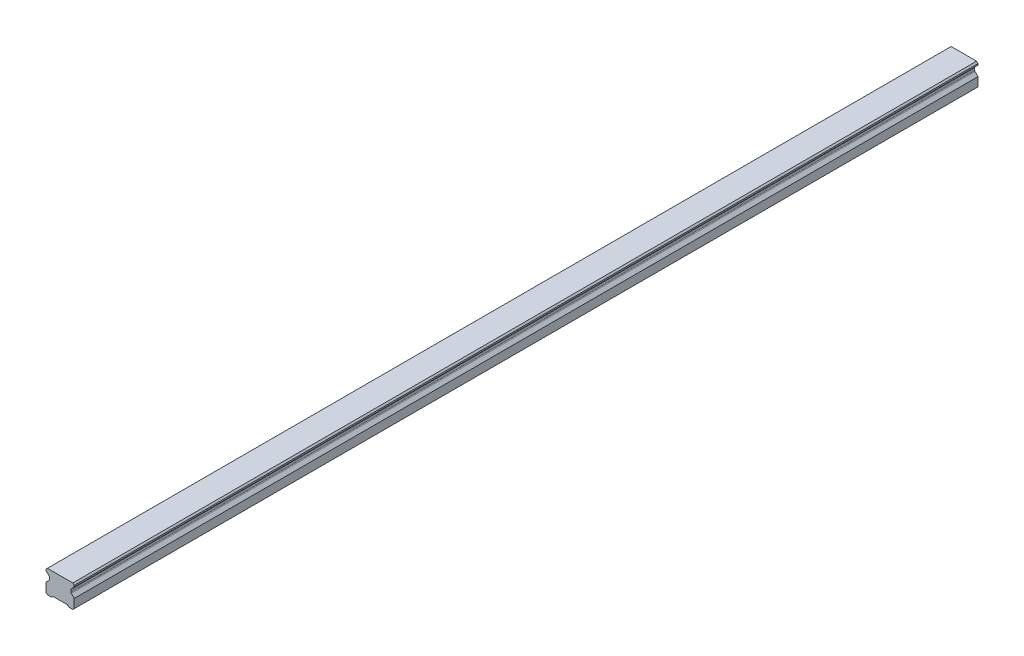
ISO-10303-21;
HEADER;
FILE_DESCRIPTION(('STEP AP214'),'2;1');
FILE_NAME('part.step','',(''),(''),'','','');
FILE_SCHEMA(('AUTOMOTIVE_DESIGN { 1 0 10303 214 1 1 1 1 }'));
ENDSEC;
DATA;
#1=APPLICATION_CONTEXT('core data for automotive mechanical design processes');
#2=APPLICATION_PROTOCOL_DEFINITION('international standard','automotive_design',2000,#1);
#3=PRODUCT_CONTEXT('',#1,'mechanical');
#4=PRODUCT('Part','Part','',(#3));
#5=PRODUCT_RELATED_PRODUCT_CATEGORY('part','',(#4));
#6=PRODUCT_DEFINITION_FORMATION('','',#4);
#7=PRODUCT_DEFINITION_CONTEXT('part definition',#1,'design');
#8=PRODUCT_DEFINITION('design','',#6,#7);
#9=PRODUCT_DEFINITION_SHAPE('','',#8);
#10=(LENGTH_UNIT() NAMED_UNIT(*) SI_UNIT(.MILLI.,.METRE.));
#11=(NAMED_UNIT(*) PLANE_ANGLE_UNIT() SI_UNIT($,.RADIAN.));
#12=(NAMED_UNIT(*) SI_UNIT($,.STERADIAN.) SOLID_ANGLE_UNIT());
#13=UNCERTAINTY_MEASURE_WITH_UNIT(LENGTH_MEASURE(1.E-05),#10,'distance_accuracy_value','');
#14=(GEOMETRIC_REPRESENTATION_CONTEXT(3) GLOBAL_UNCERTAINTY_ASSIGNED_CONTEXT((#13)) GLOBAL_UNIT_ASSIGNED_CONTEXT((#10,
#11,#12)) REPRESENTATION_CONTEXT('',''));
#15=CARTESIAN_POINT('',(0.,0.,0.));
#16=DIRECTION('',(0.,0.,1.));
#17=DIRECTION('',(1.,0.,0.));
#18=AXIS2_PLACEMENT_3D('',#15,#16,#17);
#19=CARTESIAN_POINT('',(0.,10.9999999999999,-300.));
#20=DIRECTION('',(0.,-1.,0.));
#21=DIRECTION('',(0.,0.,-1.));
#22=AXIS2_PLACEMENT_3D('',#19,#20,#21);
#23=PLANE('',#22);
#24=CARTESIAN_POINT('',(0.,10.9999999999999,-300.));
#25=DIRECTION('',(0.,-1.,0.));
#26=DIRECTION('',(0.,0.,-1.));
#27=AXIS2_PLACEMENT_3D('',#24,#25,#26);
#28=CIRCLE('',#27,2.5);
#29=CARTESIAN_POINT('',(0.,10.9999999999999,-302.5));
#30=VERTEX_POINT('',#29);
#31=EDGE_CURVE('E42',#30,#30,#28,.T.);
#32=ORIENTED_EDGE('',*,*,#31,.F.);
#33=EDGE_LOOP('',(#32));
#34=FACE_BOUND('',#33,.T.);
#35=CARTESIAN_POINT('',(0.,10.9999999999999,-300.));
#36=DIRECTION('',(0.,-1.,0.));
#37=DIRECTION('',(0.,0.,-1.));
#38=AXIS2_PLACEMENT_3D('',#35,#36,#37);
#39=CIRCLE('',#38,3.);
#40=CARTESIAN_POINT('',(0.,10.9999999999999,-303.));
#41=VERTEX_POINT('',#40);
#42=EDGE_CURVE('E11',#41,#41,#39,.T.);
#43=ORIENTED_EDGE('',*,*,#42,.T.);
#44=EDGE_LOOP('',(#43));
#45=FACE_BOUND('',#44,.T.);
#46=ADVANCED_FACE('F39',(#34,#45),#23,.T.);
#47=CARTESIAN_POINT('',(0.,10.9999999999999,-300.));
#48=DIRECTION('',(0.,-1.,0.));
#49=DIRECTION('',(0.,0.,-1.));
#50=AXIS2_PLACEMENT_3D('',#47,#48,#49);
#51=CYLINDRICAL_SURFACE('',#50,3.);
#52=ORIENTED_EDGE('',*,*,#42,.F.);
#53=EDGE_LOOP('',(#52));
#54=FACE_BOUND('',#53,.T.);
#55=CARTESIAN_POINT('',(0.,0.999999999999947,-300.));
#56=DIRECTION('',(0.,-1.,0.));
#57=DIRECTION('',(0.,0.,-1.));
#58=AXIS2_PLACEMENT_3D('',#55,#56,#57);
#59=CIRCLE('',#58,3.);
#60=CARTESIAN_POINT('',(0.,0.999999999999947,-303.));
#61=VERTEX_POINT('',#60);
#62=EDGE_CURVE('E48',#61,#61,#59,.T.);
#63=ORIENTED_EDGE('',*,*,#62,.T.);
#64=EDGE_LOOP('',(#63));
#65=FACE_BOUND('',#64,.T.);
#66=ADVANCED_FACE('F652',(#54,#65),#51,.F.);
#67=CARTESIAN_POINT('',(0.,10.9999999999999,-240.));
#68=DIRECTION('',(0.,-1.,0.));
#69=DIRECTION('',(0.,0.,-1.));
#70=AXIS2_PLACEMENT_3D('',#67,#68,#69);
#71=PLANE('',#70);
#72=CARTESIAN_POINT('',(0.,10.9999999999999,-240.));
#73=DIRECTION('',(0.,-1.,0.));
#74=DIRECTION('',(0.,0.,-1.));
#75=AXIS2_PLACEMENT_3D('',#72,#73,#74);
#76=CIRCLE('',#75,2.5);
#77=CARTESIAN_POINT('',(0.,10.9999999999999,-242.5));
#78=VERTEX_POINT('',#77);
#79=EDGE_CURVE('E638',#78,#78,#76,.T.);
#80=ORIENTED_EDGE('',*,*,#79,.F.);
#81=EDGE_LOOP('',(#80));
#82=FACE_BOUND('',#81,.T.);
#83=CARTESIAN_POINT('',(0.,10.9999999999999,-240.));
#84=DIRECTION('',(0.,-1.,0.));
#85=DIRECTION('',(0.,0.,-1.));
#86=AXIS2_PLACEMENT_3D('',#83,#84,#85);
#87=CIRCLE('',#86,3.);
#88=CARTESIAN_POINT('',(0.,10.9999999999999,-243.));
#89=VERTEX_POINT('',#88);
#90=EDGE_CURVE('E605',#89,#89,#87,.T.);
#91=ORIENTED_EDGE('',*,*,#90,.T.);
#92=EDGE_LOOP('',(#91));
#93=FACE_BOUND('',#92,.T.);
#94=ADVANCED_FACE('F657',(#82,#93),#71,.T.);
#95=CARTESIAN_POINT('',(0.,10.9999999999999,-240.));
#96=DIRECTION('',(0.,-1.,0.));
#97=DIRECTION('',(0.,0.,-1.));
#98=AXIS2_PLACEMENT_3D('',#95,#96,#97);
#99=CYLINDRICAL_SURFACE('',#98,3.);
#100=ORIENTED_EDGE('',*,*,#90,.F.);
#101=EDGE_LOOP('',(#100));
#102=FACE_BOUND('',#101,.T.);
#103=CARTESIAN_POINT('',(0.,0.999999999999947,-240.));
#104=DIRECTION('',(0.,-1.,0.));
#105=DIRECTION('',(0.,0.,-1.));
#106=AXIS2_PLACEMENT_3D('',#103,#104,#105);
#107=CIRCLE('',#106,3.);
#108=CARTESIAN_POINT('',(0.,0.999999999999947,-243.));
#109=VERTEX_POINT('',#108);
#110=EDGE_CURVE('E601',#109,#109,#107,.T.);
#111=ORIENTED_EDGE('',*,*,#110,.T.);
#112=EDGE_LOOP('',(#111));
#113=FACE_BOUND('',#112,.T.);
#114=ADVANCED_FACE('F816',(#102,#113),#99,.F.);
#115=CARTESIAN_POINT('',(0.,10.9999999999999,-180.));
#116=DIRECTION('',(0.,-1.,0.));
#117=DIRECTION('',(0.,0.,-1.));
#118=AXIS2_PLACEMENT_3D('',#115,#116,#117);
#119=PLANE('',#118);
#120=CARTESIAN_POINT('',(0.,10.9999999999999,-180.));
#121=DIRECTION('',(0.,-1.,0.));
#122=DIRECTION('',(0.,0.,-1.));
#123=AXIS2_PLACEMENT_3D('',#120,#121,#122);
#124=CIRCLE('',#123,2.5);
#125=CARTESIAN_POINT('',(0.,10.9999999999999,-182.5));
#126=VERTEX_POINT('',#125);
#127=EDGE_CURVE('E635',#126,#126,#124,.T.);
#128=ORIENTED_EDGE('',*,*,#127,.F.);
#129=EDGE_LOOP('',(#128));
#130=FACE_BOUND('',#129,.T.);
#131=CARTESIAN_POINT('',(0.,10.9999999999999,-180.));
#132=DIRECTION('',(0.,-1.,0.));
#133=DIRECTION('',(0.,0.,-1.));
#134=AXIS2_PLACEMENT_3D('',#131,#132,#133);
#135=CIRCLE('',#134,3.);
#136=CARTESIAN_POINT('',(0.,10.9999999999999,-183.));
#137=VERTEX_POINT('',#136);
#138=EDGE_CURVE('E597',#137,#137,#135,.T.);
#139=ORIENTED_EDGE('',*,*,#138,.T.);
#140=EDGE_LOOP('',(#139));
#141=FACE_BOUND('',#140,.T.);
#142=ADVANCED_FACE('F812',(#130,#141),#119,.T.);
#143=CARTESIAN_POINT('',(0.,10.9999999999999,-180.));
#144=DIRECTION('',(0.,-1.,0.));
#145=DIRECTION('',(0.,0.,-1.));
#146=AXIS2_PLACEMENT_3D('',#143,#144,#145);
#147=CYLINDRICAL_SURFACE('',#146,3.);
#148=ORIENTED_EDGE('',*,*,#138,.F.);
#149=EDGE_LOOP('',(#148));
#150=FACE_BOUND('',#149,.T.);
#151=CARTESIAN_POINT('',(0.,0.999999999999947,-180.));
#152=DIRECTION('',(0.,-1.,0.));
#153=DIRECTION('',(0.,0.,-1.));
#154=AXIS2_PLACEMENT_3D('',#151,#152,#153);
#155=CIRCLE('',#154,3.);
#156=CARTESIAN_POINT('',(0.,0.999999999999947,-183.));
#157=VERTEX_POINT('',#156);
#158=EDGE_CURVE('E593',#157,#157,#155,.T.);
#159=ORIENTED_EDGE('',*,*,#158,.T.);
#160=EDGE_LOOP('',(#159));
#161=FACE_BOUND('',#160,.T.);
#162=ADVANCED_FACE('F808',(#150,#161),#147,.F.);
#163=CARTESIAN_POINT('',(0.,10.9999999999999,-120.));
#164=DIRECTION('',(0.,-1.,0.));
#165=DIRECTION('',(0.,0.,-1.));
#166=AXIS2_PLACEMENT_3D('',#163,#164,#165);
#167=PLANE('',#166);
#168=CARTESIAN_POINT('',(0.,10.9999999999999,-120.));
#169=DIRECTION('',(0.,-1.,0.));
#170=DIRECTION('',(0.,0.,-1.));
#171=AXIS2_PLACEMENT_3D('',#168,#169,#170);
#172=CIRCLE('',#171,2.5);
#173=CARTESIAN_POINT('',(0.,10.9999999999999,-122.5));
#174=VERTEX_POINT('',#173);
#175=EDGE_CURVE('E631',#174,#174,#172,.T.);
#176=ORIENTED_EDGE('',*,*,#175,.F.);
#177=EDGE_LOOP('',(#176));
#178=FACE_BOUND('',#177,.T.);
#179=CARTESIAN_POINT('',(0.,10.9999999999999,-120.));
#180=DIRECTION('',(0.,-1.,0.));
#181=DIRECTION('',(0.,0.,-1.));
#182=AXIS2_PLACEMENT_3D('',#179,#180,#181);
#183=CIRCLE('',#182,3.);
#184=CARTESIAN_POINT('',(0.,10.9999999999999,-123.));
#185=VERTEX_POINT('',#184);
#186=EDGE_CURVE('E589',#185,#185,#183,.T.);
#187=ORIENTED_EDGE('',*,*,#186,.T.);
#188=EDGE_LOOP('',(#187));
#189=FACE_BOUND('',#188,.T.);
#190=ADVANCED_FACE('F804',(#178,#189),#167,.T.);
#191=CARTESIAN_POINT('',(0.,10.9999999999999,-120.));
#192=DIRECTION('',(0.,-1.,0.));
#193=DIRECTION('',(0.,0.,-1.));
#194=AXIS2_PLACEMENT_3D('',#191,#192,#193);
#195=CYLINDRICAL_SURFACE('',#194,3.);
#196=ORIENTED_EDGE('',*,*,#186,.F.);
#197=EDGE_LOOP('',(#196));
#198=FACE_BOUND('',#197,.T.);
#199=CARTESIAN_POINT('',(0.,0.999999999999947,-120.));
#200=DIRECTION('',(0.,-1.,0.));
#201=DIRECTION('',(0.,0.,-1.));
#202=AXIS2_PLACEMENT_3D('',#199,#200,#201);
#203=CIRCLE('',#202,3.);
#204=CARTESIAN_POINT('',(0.,0.999999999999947,-123.));
#205=VERTEX_POINT('',#204);
#206=EDGE_CURVE('E585',#205,#205,#203,.T.);
#207=ORIENTED_EDGE('',*,*,#206,.T.);
#208=EDGE_LOOP('',(#207));
#209=FACE_BOUND('',#208,.T.);
#210=ADVANCED_FACE('F800',(#198,#209),#195,.F.);
#211=CARTESIAN_POINT('',(0.,10.9999999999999,-60.));
#212=DIRECTION('',(0.,-1.,0.));
#213=DIRECTION('',(0.,0.,-1.));
#214=AXIS2_PLACEMENT_3D('',#211,#212,#213);
#215=PLANE('',#214);
#216=CARTESIAN_POINT('',(0.,10.9999999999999,-60.));
#217=DIRECTION('',(0.,-1.,0.));
#218=DIRECTION('',(0.,0.,-1.));
#219=AXIS2_PLACEMENT_3D('',#216,#217,#218);
#220=CIRCLE('',#219,2.5);
#221=CARTESIAN_POINT('',(0.,10.9999999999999,-62.5));
#222=VERTEX_POINT('',#221);
#223=EDGE_CURVE('E627',#222,#222,#220,.T.);
#224=ORIENTED_EDGE('',*,*,#223,.F.);
#225=EDGE_LOOP('',(#224));
#226=FACE_BOUND('',#225,.T.);
#227=CARTESIAN_POINT('',(0.,10.9999999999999,-60.));
#228=DIRECTION('',(0.,-1.,0.));
#229=DIRECTION('',(0.,0.,-1.));
#230=AXIS2_PLACEMENT_3D('',#227,#228,#229);
#231=CIRCLE('',#230,3.);
#232=CARTESIAN_POINT('',(0.,10.9999999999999,-63.));
#233=VERTEX_POINT('',#232);
#234=EDGE_CURVE('E581',#233,#233,#231,.T.);
#235=ORIENTED_EDGE('',*,*,#234,.T.);
#236=EDGE_LOOP('',(#235));
#237=FACE_BOUND('',#236,.T.);
#238=ADVANCED_FACE('F796',(#226,#237),#215,.T.);
#239=CARTESIAN_POINT('',(0.,10.9999999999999,-60.));
#240=DIRECTION('',(0.,-1.,0.));
#241=DIRECTION('',(0.,0.,-1.));
#242=AXIS2_PLACEMENT_3D('',#239,#240,#241);
#243=CYLINDRICAL_SURFACE('',#242,3.);
#244=ORIENTED_EDGE('',*,*,#234,.F.);
#245=EDGE_LOOP('',(#244));
#246=FACE_BOUND('',#245,.T.);
#247=CARTESIAN_POINT('',(0.,0.999999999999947,-60.));
#248=DIRECTION('',(0.,-1.,0.));
#249=DIRECTION('',(0.,0.,-1.));
#250=AXIS2_PLACEMENT_3D('',#247,#248,#249);
#251=CIRCLE('',#250,3.);
#252=CARTESIAN_POINT('',(0.,0.999999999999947,-63.));
#253=VERTEX_POINT('',#252);
#254=EDGE_CURVE('E577',#253,#253,#251,.T.);
#255=ORIENTED_EDGE('',*,*,#254,.T.);
#256=EDGE_LOOP('',(#255));
#257=FACE_BOUND('',#256,.T.);
#258=ADVANCED_FACE('F792',(#246,#257),#243,.F.);
#259=CARTESIAN_POINT('',(0.,10.9999999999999,0.));
#260=DIRECTION('',(0.,-1.,0.));
#261=DIRECTION('',(0.,0.,-1.));
#262=AXIS2_PLACEMENT_3D('',#259,#260,#261);
#263=PLANE('',#262);
#264=CARTESIAN_POINT('',(0.,10.9999999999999,0.));
#265=DIRECTION('',(0.,-1.,0.));
#266=DIRECTION('',(0.,0.,-1.));
#267=AXIS2_PLACEMENT_3D('',#264,#265,#266);
#268=CIRCLE('',#267,2.5);
#269=CARTESIAN_POINT('',(0.,10.9999999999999,-2.5));
#270=VERTEX_POINT('',#269);
#271=EDGE_CURVE('E623',#270,#270,#268,.T.);
#272=ORIENTED_EDGE('',*,*,#271,.F.);
#273=EDGE_LOOP('',(#272));
#274=FACE_BOUND('',#273,.T.);
#275=CARTESIAN_POINT('',(0.,10.9999999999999,0.));
#276=DIRECTION('',(0.,-1.,0.));
#277=DIRECTION('',(0.,0.,-1.));
#278=AXIS2_PLACEMENT_3D('',#275,#276,#277);
#279=CIRCLE('',#278,3.);
#280=CARTESIAN_POINT('',(0.,10.9999999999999,-3.));
#281=VERTEX_POINT('',#280);
#282=EDGE_CURVE('E573',#281,#281,#279,.T.);
#283=ORIENTED_EDGE('',*,*,#282,.T.);
#284=EDGE_LOOP('',(#283));
#285=FACE_BOUND('',#284,.T.);
#286=ADVANCED_FACE('F788',(#274,#285),#263,.T.);
#287=CARTESIAN_POINT('',(0.,10.9999999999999,0.));
#288=DIRECTION('',(0.,-1.,0.));
#289=DIRECTION('',(0.,0.,-1.));
#290=AXIS2_PLACEMENT_3D('',#287,#288,#289);
#291=CYLINDRICAL_SURFACE('',#290,3.);
#292=ORIENTED_EDGE('',*,*,#282,.F.);
#293=EDGE_LOOP('',(#292));
#294=FACE_BOUND('',#293,.T.);
#295=CARTESIAN_POINT('',(0.,0.999999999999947,0.));
#296=DIRECTION('',(0.,-1.,0.));
#297=DIRECTION('',(0.,0.,-1.));
#298=AXIS2_PLACEMENT_3D('',#295,#296,#297);
#299=CIRCLE('',#298,3.);
#300=CARTESIAN_POINT('',(0.,0.999999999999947,-3.));
#301=VERTEX_POINT('',#300);
#302=EDGE_CURVE('E569',#301,#301,#299,.T.);
#303=ORIENTED_EDGE('',*,*,#302,.T.);
#304=EDGE_LOOP('',(#303));
#305=FACE_BOUND('',#304,.T.);
#306=ADVANCED_FACE('F784',(#294,#305),#291,.F.);
#307=CARTESIAN_POINT('',(0.,10.9999999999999,60.));
#308=DIRECTION('',(0.,-1.,0.));
#309=DIRECTION('',(0.,0.,-1.));
#310=AXIS2_PLACEMENT_3D('',#307,#308,#309);
#311=PLANE('',#310);
#312=CARTESIAN_POINT('',(0.,10.9999999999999,60.));
#313=DIRECTION('',(0.,-1.,0.));
#314=DIRECTION('',(0.,0.,-1.));
#315=AXIS2_PLACEMENT_3D('',#312,#313,#314);
#316=CIRCLE('',#315,2.5);
#317=CARTESIAN_POINT('',(0.,10.9999999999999,57.5));
#318=VERTEX_POINT('',#317);
#319=EDGE_CURVE('E619',#318,#318,#316,.T.);
#320=ORIENTED_EDGE('',*,*,#319,.F.);
#321=EDGE_LOOP('',(#320));
#322=FACE_BOUND('',#321,.T.);
#323=CARTESIAN_POINT('',(0.,10.9999999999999,60.));
#324=DIRECTION('',(0.,-1.,0.));
#325=DIRECTION('',(0.,0.,-1.));
#326=AXIS2_PLACEMENT_3D('',#323,#324,#325);
#327=CIRCLE('',#326,3.);
#328=CARTESIAN_POINT('',(0.,10.9999999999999,57.));
#329=VERTEX_POINT('',#328);
#330=EDGE_CURVE('E565',#329,#329,#327,.T.);
#331=ORIENTED_EDGE('',*,*,#330,.T.);
#332=EDGE_LOOP('',(#331));
#333=FACE_BOUND('',#332,.T.);
#334=ADVANCED_FACE('F780',(#322,#333),#311,.T.);
#335=CARTESIAN_POINT('',(0.,10.9999999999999,60.));
#336=DIRECTION('',(0.,-1.,0.));
#337=DIRECTION('',(0.,0.,-1.));
#338=AXIS2_PLACEMENT_3D('',#335,#336,#337);
#339=CYLINDRICAL_SURFACE('',#338,3.);
#340=ORIENTED_EDGE('',*,*,#330,.F.);
#341=EDGE_LOOP('',(#340));
#342=FACE_BOUND('',#341,.T.);
#343=CARTESIAN_POINT('',(0.,0.999999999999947,60.));
#344=DIRECTION('',(0.,-1.,0.));
#345=DIRECTION('',(0.,0.,-1.));
#346=AXIS2_PLACEMENT_3D('',#343,#344,#345);
#347=CIRCLE('',#346,3.);
#348=CARTESIAN_POINT('',(0.,0.999999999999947,57.));
#349=VERTEX_POINT('',#348);
#350=EDGE_CURVE('E561',#349,#349,#347,.T.);
#351=ORIENTED_EDGE('',*,*,#350,.T.);
#352=EDGE_LOOP('',(#351));
#353=FACE_BOUND('',#352,.T.);
#354=ADVANCED_FACE('F776',(#342,#353),#339,.F.);
#355=CARTESIAN_POINT('',(0.,10.9999999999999,120.));
#356=DIRECTION('',(0.,-1.,0.));
#357=DIRECTION('',(0.,0.,-1.));
#358=AXIS2_PLACEMENT_3D('',#355,#356,#357);
#359=PLANE('',#358);
#360=CARTESIAN_POINT('',(0.,10.9999999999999,120.));
#361=DIRECTION('',(0.,-1.,0.));
#362=DIRECTION('',(0.,0.,-1.));
#363=AXIS2_PLACEMENT_3D('',#360,#361,#362);
#364=CIRCLE('',#363,2.5);
#365=CARTESIAN_POINT('',(0.,10.9999999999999,117.5));
#366=VERTEX_POINT('',#365);
#367=EDGE_CURVE('E615',#366,#366,#364,.T.);
#368=ORIENTED_EDGE('',*,*,#367,.F.);
#369=EDGE_LOOP('',(#368));
#370=FACE_BOUND('',#369,.T.);
#371=CARTESIAN_POINT('',(0.,10.9999999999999,120.));
#372=DIRECTION('',(0.,-1.,0.));
#373=DIRECTION('',(0.,0.,-1.));
#374=AXIS2_PLACEMENT_3D('',#371,#372,#373);
#375=CIRCLE('',#374,3.);
#376=CARTESIAN_POINT('',(0.,10.9999999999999,117.));
#377=VERTEX_POINT('',#376);
#378=EDGE_CURVE('E557',#377,#377,#375,.T.);
#379=ORIENTED_EDGE('',*,*,#378,.T.);
#380=EDGE_LOOP('',(#379));
#381=FACE_BOUND('',#380,.T.);
#382=ADVANCED_FACE('F772',(#370,#381),#359,.T.);
#383=CARTESIAN_POINT('',(0.,10.9999999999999,120.));
#384=DIRECTION('',(0.,-1.,0.));
#385=DIRECTION('',(0.,0.,-1.));
#386=AXIS2_PLACEMENT_3D('',#383,#384,#385);
#387=CYLINDRICAL_SURFACE('',#386,3.);
#388=ORIENTED_EDGE('',*,*,#378,.F.);
#389=EDGE_LOOP('',(#388));
#390=FACE_BOUND('',#389,.T.);
#391=CARTESIAN_POINT('',(0.,0.999999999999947,120.));
#392=DIRECTION('',(0.,-1.,0.));
#393=DIRECTION('',(0.,0.,-1.));
#394=AXIS2_PLACEMENT_3D('',#391,#392,#393);
#395=CIRCLE('',#394,3.);
#396=CARTESIAN_POINT('',(0.,0.999999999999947,117.));
#397=VERTEX_POINT('',#396);
#398=EDGE_CURVE('E553',#397,#397,#395,.T.);
#399=ORIENTED_EDGE('',*,*,#398,.T.);
#400=EDGE_LOOP('',(#399));
#401=FACE_BOUND('',#400,.T.);
#402=ADVANCED_FACE('F768',(#390,#401),#387,.F.);
#403=CARTESIAN_POINT('',(0.,10.9999999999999,180.));
#404=DIRECTION('',(0.,-1.,0.));
#405=DIRECTION('',(0.,0.,-1.));
#406=AXIS2_PLACEMENT_3D('',#403,#404,#405);
#407=PLANE('',#406);
#408=CARTESIAN_POINT('',(0.,10.9999999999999,180.));
#409=DIRECTION('',(0.,-1.,0.));
#410=DIRECTION('',(0.,0.,-1.));
#411=AXIS2_PLACEMENT_3D('',#408,#409,#410);
#412=CIRCLE('',#411,2.5);
#413=CARTESIAN_POINT('',(0.,10.9999999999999,177.5));
#414=VERTEX_POINT('',#413);
#415=EDGE_CURVE('E251',#414,#414,#412,.T.);
#416=ORIENTED_EDGE('',*,*,#415,.F.);
#417=EDGE_LOOP('',(#416));
#418=FACE_BOUND('',#417,.T.);
#419=CARTESIAN_POINT('',(0.,10.9999999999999,180.));
#420=DIRECTION('',(0.,-1.,0.));
#421=DIRECTION('',(0.,0.,-1.));
#422=AXIS2_PLACEMENT_3D('',#419,#420,#421);
#423=CIRCLE('',#422,3.);
#424=CARTESIAN_POINT('',(0.,10.9999999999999,177.));
#425=VERTEX_POINT('',#424);
#426=EDGE_CURVE('E549',#425,#425,#423,.T.);
#427=ORIENTED_EDGE('',*,*,#426,.T.);
#428=EDGE_LOOP('',(#427));
#429=FACE_BOUND('',#428,.T.);
#430=ADVANCED_FACE('F764',(#418,#429),#407,.T.);
#431=CARTESIAN_POINT('',(0.,10.9999999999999,180.));
#432=DIRECTION('',(0.,-1.,0.));
#433=DIRECTION('',(0.,0.,-1.));
#434=AXIS2_PLACEMENT_3D('',#431,#432,#433);
#435=CYLINDRICAL_SURFACE('',#434,3.);
#436=ORIENTED_EDGE('',*,*,#426,.F.);
#437=EDGE_LOOP('',(#436));
#438=FACE_BOUND('',#437,.T.);
#439=CARTESIAN_POINT('',(0.,0.999999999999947,180.));
#440=DIRECTION('',(0.,-1.,0.));
#441=DIRECTION('',(0.,0.,-1.));
#442=AXIS2_PLACEMENT_3D('',#439,#440,#441);
#443=CIRCLE('',#442,3.);
#444=CARTESIAN_POINT('',(0.,0.999999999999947,177.));
#445=VERTEX_POINT('',#444);
#446=EDGE_CURVE('E545',#445,#445,#443,.T.);
#447=ORIENTED_EDGE('',*,*,#446,.T.);
#448=EDGE_LOOP('',(#447));
#449=FACE_BOUND('',#448,.T.);
#450=ADVANCED_FACE('F761',(#438,#449),#435,.F.);
#451=CARTESIAN_POINT('',(10.,0.,320.));
#452=DIRECTION('',(0.,1.,0.));
#453=DIRECTION('',(-1.,0.,0.));
#454=AXIS2_PLACEMENT_3D('',#451,#452,#453);
#455=PLANE('',#454);
#456=DIRECTION('',(1.,0.,0.));
#457=VECTOR('',#456,1.);
#458=CARTESIAN_POINT('',(10.,0.,-320.));
#459=LINE('',#458,#457);
#460=CARTESIAN_POINT('',(-9.00000000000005,0.,-320.));
#461=VERTEX_POINT('',#460);
#462=CARTESIAN_POINT('',(-5.99999999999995,0.,-320.));
#463=VERTEX_POINT('',#462);
#464=EDGE_CURVE('E428',#461,#463,#459,.T.);
#465=ORIENTED_EDGE('',*,*,#464,.T.);
#466=DIRECTION('',(0.,0.,1.));
#467=VECTOR('',#466,1.);
#468=CARTESIAN_POINT('',(-5.99999999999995,0.,-320.));
#469=LINE('',#468,#467);
#470=CARTESIAN_POINT('',(-5.99999999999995,0.,320.));
#471=VERTEX_POINT('',#470);
#472=EDGE_CURVE('E333',#463,#471,#469,.T.);
#473=ORIENTED_EDGE('',*,*,#472,.T.);
#474=DIRECTION('',(1.,0.,0.));
#475=VECTOR('',#474,1.);
#476=CARTESIAN_POINT('',(10.,0.,320.));
#477=LINE('',#476,#475);
#478=CARTESIAN_POINT('',(-9.00000000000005,0.,320.));
#479=VERTEX_POINT('',#478);
#480=EDGE_CURVE('E409',#479,#471,#477,.T.);
#481=ORIENTED_EDGE('',*,*,#480,.F.);
#482=DIRECTION('',(0.,0.,-1.));
#483=VECTOR('',#482,1.);
#484=CARTESIAN_POINT('',(-9.00000000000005,0.,320.));
#485=LINE('',#484,#483);
#486=EDGE_CURVE('E480',#479,#461,#485,.T.);
#487=ORIENTED_EDGE('',*,*,#486,.T.);
#488=EDGE_LOOP('',(#465,#473,#481,#487));
#489=FACE_BOUND('',#488,.T.);
#490=ADVANCED_FACE('F726',(#489),#455,.F.);
#491=CARTESIAN_POINT('',(-10.,16.3,320.));
#492=DIRECTION('',(1.,0.,0.));
#493=DIRECTION('',(0.,1.,0.));
#494=AXIS2_PLACEMENT_3D('',#491,#492,#493);
#495=PLANE('',#494);
#496=DIRECTION('',(0.,-1.,0.));
#497=VECTOR('',#496,1.);
#498=CARTESIAN_POINT('',(-10.,16.3,320.));
#499=LINE('',#498,#497);
#500=CARTESIAN_POINT('',(-10.,15.3000000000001,320.));
#501=VERTEX_POINT('',#500);
#502=CARTESIAN_POINT('',(-10.,14.3,320.));
#503=VERTEX_POINT('',#502);
#504=EDGE_CURVE('E403',#501,#503,#499,.T.);
#505=ORIENTED_EDGE('',*,*,#504,.F.);
#506=DIRECTION('',(0.,0.,-1.));
#507=VECTOR('',#506,1.);
#508=CARTESIAN_POINT('',(-10.,15.3000000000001,320.));
#509=LINE('',#508,#507);
#510=CARTESIAN_POINT('',(-10.,15.3000000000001,-320.));
#511=VERTEX_POINT('',#510);
#512=EDGE_CURVE('E422',#501,#511,#509,.T.);
#513=ORIENTED_EDGE('',*,*,#512,.T.);
#514=DIRECTION('',(0.,-1.,0.));
#515=VECTOR('',#514,1.);
#516=CARTESIAN_POINT('',(-10.,16.3,-320.));
#517=LINE('',#516,#515);
#518=CARTESIAN_POINT('',(-10.,14.3,-320.));
#519=VERTEX_POINT('',#518);
#520=EDGE_CURVE('E423',#511,#519,#517,.T.);
#521=ORIENTED_EDGE('',*,*,#520,.T.);
#522=DIRECTION('',(0.,0.,1.));
#523=VECTOR('',#522,1.);
#524=CARTESIAN_POINT('',(-10.,14.3,-320.));
#525=LINE('',#524,#523);
#526=EDGE_CURVE('E357',#519,#503,#525,.T.);
#527=ORIENTED_EDGE('',*,*,#526,.T.);
#528=EDGE_LOOP('',(#505,#513,#521,#527));
#529=FACE_BOUND('',#528,.T.);
#530=ADVANCED_FACE('F730',(#529),#495,.F.);
#531=CARTESIAN_POINT('',(10.,16.3,320.));
#532=DIRECTION('',(-1.,0.,0.));
#533=DIRECTION('',(0.,-1.,0.));
#534=AXIS2_PLACEMENT_3D('',#531,#532,#533);
#535=PLANE('',#534);
#536=DIRECTION('',(0.,1.,0.));
#537=VECTOR('',#536,1.);
#538=CARTESIAN_POINT('',(10.,16.3,320.));
#539=LINE('',#538,#537);
#540=CARTESIAN_POINT('',(10.,0.999999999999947,320.));
#541=VERTEX_POINT('',#540);
#542=CARTESIAN_POINT('',(10.,7.3,320.));
#543=VERTEX_POINT('',#542);
#544=EDGE_CURVE('E414',#541,#543,#539,.T.);
#545=ORIENTED_EDGE('',*,*,#544,.F.);
#546=DIRECTION('',(0.,0.,-1.));
#547=VECTOR('',#546,1.);
#548=CARTESIAN_POINT('',(10.,0.999999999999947,320.));
#549=LINE('',#548,#547);
#550=CARTESIAN_POINT('',(10.,0.999999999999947,-320.));
#551=VERTEX_POINT('',#550);
#552=EDGE_CURVE('E487',#541,#551,#549,.T.);
#553=ORIENTED_EDGE('',*,*,#552,.T.);
#554=DIRECTION('',(0.,1.,0.));
#555=VECTOR('',#554,1.);
#556=CARTESIAN_POINT('',(10.,16.3,-320.));
#557=LINE('',#556,#555);
#558=CARTESIAN_POINT('',(10.,7.3,-320.));
#559=VERTEX_POINT('',#558);
#560=EDGE_CURVE('E433',#551,#559,#557,.T.);
#561=ORIENTED_EDGE('',*,*,#560,.T.);
#562=DIRECTION('',(0.,0.,1.));
#563=VECTOR('',#562,1.);
#564=CARTESIAN_POINT('',(10.,7.3,-320.));
#565=LINE('',#564,#563);
#566=EDGE_CURVE('E388',#559,#543,#565,.T.);
#567=ORIENTED_EDGE('',*,*,#566,.T.);
#568=EDGE_LOOP('',(#545,#553,#561,#567));
#569=FACE_BOUND('',#568,.T.);
#570=ADVANCED_FACE('F721',(#569),#535,.F.);
#571=CARTESIAN_POINT('',(-10.,7.3,-320.));
#572=VERTEX_POINT('',#571);
#573=CARTESIAN_POINT('',(-10.,0.999999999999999,-320.));
#574=VERTEX_POINT('',#573);
#575=EDGE_CURVE('E372',#572,#574,#517,.T.);
#576=ORIENTED_EDGE('',*,*,#575,.T.);
#577=DIRECTION('',(0.,0.,1.));
#578=VECTOR('',#577,1.);
#579=CARTESIAN_POINT('',(-10.,0.999999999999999,320.));
#580=LINE('',#579,#578);
#581=CARTESIAN_POINT('',(-10.,0.999999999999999,320.));
#582=VERTEX_POINT('',#581);
#583=EDGE_CURVE('E484',#574,#582,#580,.T.);
#584=ORIENTED_EDGE('',*,*,#583,.T.);
#585=CARTESIAN_POINT('',(-10.,7.3,320.));
#586=VERTEX_POINT('',#585);
#587=EDGE_CURVE('E408',#586,#582,#499,.T.);
#588=ORIENTED_EDGE('',*,*,#587,.F.);
#589=DIRECTION('',(0.,0.,1.));
#590=VECTOR('',#589,1.);
#591=CARTESIAN_POINT('',(-10.,7.3,-320.));
#592=LINE('',#591,#590);
#593=EDGE_CURVE('E369',#572,#586,#592,.T.);
#594=ORIENTED_EDGE('',*,*,#593,.F.);
#595=EDGE_LOOP('',(#576,#584,#588,#594));
#596=FACE_BOUND('',#595,.T.);
#597=ADVANCED_FACE('F724',(#596),#495,.F.);
#598=CARTESIAN_POINT('',(5.99999999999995,0.,320.));
#599=VERTEX_POINT('',#598);
#600=CARTESIAN_POINT('',(9.00000000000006,0.,320.));
#601=VERTEX_POINT('',#600);
#602=EDGE_CURVE('E407',#599,#601,#477,.T.);
#603=ORIENTED_EDGE('',*,*,#602,.F.);
#604=DIRECTION('',(0.,0.,1.));
#605=VECTOR('',#604,1.);
#606=CARTESIAN_POINT('',(5.99999999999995,0.,-320.));
#607=LINE('',#606,#605);
#608=CARTESIAN_POINT('',(5.99999999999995,0.,-320.));
#609=VERTEX_POINT('',#608);
#610=EDGE_CURVE('E323',#609,#599,#607,.T.);
#611=ORIENTED_EDGE('',*,*,#610,.F.);
#612=CARTESIAN_POINT('',(9.00000000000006,0.,-320.));
#613=VERTEX_POINT('',#612);
#614=EDGE_CURVE('E427',#609,#613,#459,.T.);
#615=ORIENTED_EDGE('',*,*,#614,.T.);
#616=DIRECTION('',(0.,0.,1.));
#617=VECTOR('',#616,1.);
#618=CARTESIAN_POINT('',(9.00000000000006,0.,320.));
#619=LINE('',#618,#617);
#620=EDGE_CURVE('E476',#613,#601,#619,.T.);
#621=ORIENTED_EDGE('',*,*,#620,.T.);
#622=EDGE_LOOP('',(#603,#611,#615,#621));
#623=FACE_BOUND('',#622,.T.);
#624=ADVANCED_FACE('F719',(#623),#455,.F.);
#625=CARTESIAN_POINT('',(10.,14.3,-320.));
#626=VERTEX_POINT('',#625);
#627=CARTESIAN_POINT('',(10.,15.3,-320.));
#628=VERTEX_POINT('',#627);
#629=EDGE_CURVE('E432',#626,#628,#557,.T.);
#630=ORIENTED_EDGE('',*,*,#629,.T.);
#631=DIRECTION('',(0.,0.,1.));
#632=VECTOR('',#631,1.);
#633=CARTESIAN_POINT('',(10.,15.3,320.));
#634=LINE('',#633,#632);
#635=CARTESIAN_POINT('',(10.,15.3,320.));
#636=VERTEX_POINT('',#635);
#637=EDGE_CURVE('E491',#628,#636,#634,.T.);
#638=ORIENTED_EDGE('',*,*,#637,.T.);
#639=CARTESIAN_POINT('',(10.,14.3,320.));
#640=VERTEX_POINT('',#639);
#641=EDGE_CURVE('E413',#640,#636,#539,.T.);
#642=ORIENTED_EDGE('',*,*,#641,.F.);
#643=DIRECTION('',(0.,0.,1.));
#644=VECTOR('',#643,1.);
#645=CARTESIAN_POINT('',(10.,14.3,-320.));
#646=LINE('',#645,#644);
#647=EDGE_CURVE('E362',#626,#640,#646,.T.);
#648=ORIENTED_EDGE('',*,*,#647,.F.);
#649=EDGE_LOOP('',(#630,#638,#642,#648));
#650=FACE_BOUND('',#649,.T.);
#651=ADVANCED_FACE('F715',(#650),#535,.F.);
#652=CARTESIAN_POINT('',(10.,16.3,320.));
#653=DIRECTION('',(0.,-1.,0.));
#654=DIRECTION('',(0.,0.,-1.));
#655=AXIS2_PLACEMENT_3D('',#652,#653,#654);
#656=PLANE('',#655);
#657=DIRECTION('',(-1.,0.,0.));
#658=VECTOR('',#657,1.);
#659=CARTESIAN_POINT('',(10.,16.3,-320.));
#660=LINE('',#659,#658);
#661=CARTESIAN_POINT('',(9.00000000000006,16.3,-320.));
#662=VERTEX_POINT('',#661);
#663=CARTESIAN_POINT('',(-9.,16.3,-320.));
#664=VERTEX_POINT('',#663);
#665=EDGE_CURVE('E437',#662,#664,#660,.T.);
#666=ORIENTED_EDGE('',*,*,#665,.T.);
#667=DIRECTION('',(0.,0.,1.));
#668=VECTOR('',#667,1.);
#669=CARTESIAN_POINT('',(-9.,16.3,320.));
#670=LINE('',#669,#668);
#671=CARTESIAN_POINT('',(-9.,16.3,320.));
#672=VERTEX_POINT('',#671);
#673=EDGE_CURVE('E461',#664,#672,#670,.T.);
#674=ORIENTED_EDGE('',*,*,#673,.T.);
#675=DIRECTION('',(-1.,0.,0.));
#676=VECTOR('',#675,1.);
#677=CARTESIAN_POINT('',(10.,16.3,320.));
#678=LINE('',#677,#676);
#679=CARTESIAN_POINT('',(9.00000000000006,16.3,320.));
#680=VERTEX_POINT('',#679);
#681=EDGE_CURVE('E418',#680,#672,#678,.T.);
#682=ORIENTED_EDGE('',*,*,#681,.F.);
#683=DIRECTION('',(0.,0.,-1.));
#684=VECTOR('',#683,1.);
#685=CARTESIAN_POINT('',(9.00000000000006,16.3,320.));
#686=LINE('',#685,#684);
#687=EDGE_CURVE('E457',#680,#662,#686,.T.);
#688=ORIENTED_EDGE('',*,*,#687,.T.);
#689=EDGE_LOOP('',(#666,#674,#682,#688));
#690=FACE_BOUND('',#689,.T.);
#691=ADVANCED_FACE('F709',(#690),#656,.F.);
#692=CARTESIAN_POINT('',(0.,0.,320.));
#693=DIRECTION('',(0.,0.,-1.));
#694=DIRECTION('',(-1.,0.,0.));
#695=AXIS2_PLACEMENT_3D('',#692,#693,#694);
#696=PLANE('',#695);
#697=ORIENTED_EDGE('',*,*,#480,.T.);
#698=DIRECTION('',(-0.707106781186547,-0.707106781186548,0.));
#699=VECTOR('',#698,1.);
#700=CARTESIAN_POINT('',(-5.99999999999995,0.,320.));
#701=LINE('',#700,#699);
#702=CARTESIAN_POINT('',(-5.,0.999999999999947,320.));
#703=VERTEX_POINT('',#702);
#704=EDGE_CURVE('E316',#703,#471,#701,.T.);
#705=ORIENTED_EDGE('',*,*,#704,.F.);
#706=DIRECTION('',(-1.,0.,0.));
#707=VECTOR('',#706,1.);
#708=CARTESIAN_POINT('',(-5.,0.999999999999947,320.));
#709=LINE('',#708,#707);
#710=CARTESIAN_POINT('',(5.,0.999999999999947,320.));
#711=VERTEX_POINT('',#710);
#712=EDGE_CURVE('E327',#711,#703,#709,.T.);
#713=ORIENTED_EDGE('',*,*,#712,.F.);
#714=DIRECTION('',(-0.707106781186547,0.707106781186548,0.));
#715=VECTOR('',#714,1.);
#716=CARTESIAN_POINT('',(5.,0.999999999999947,320.));
#717=LINE('',#716,#715);
#718=EDGE_CURVE('E309',#599,#711,#717,.T.);
#719=ORIENTED_EDGE('',*,*,#718,.F.);
#720=ORIENTED_EDGE('',*,*,#602,.T.);
#721=DIRECTION('',(-0.707106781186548,-0.707106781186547,0.));
#722=VECTOR('',#721,1.);
#723=CARTESIAN_POINT('',(10.,0.999999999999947,320.));
#724=LINE('',#723,#722);
#725=EDGE_CURVE('E467',#601,#541,#724,.F.);
#726=ORIENTED_EDGE('',*,*,#725,.T.);
#727=ORIENTED_EDGE('',*,*,#544,.T.);
#728=DIRECTION('',(0.707106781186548,-0.707106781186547,0.));
#729=VECTOR('',#728,1.);
#730=CARTESIAN_POINT('',(10.,7.3,320.));
#731=LINE('',#730,#729);
#732=CARTESIAN_POINT('',(7.95955988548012,9.34044011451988,320.));
#733=VERTEX_POINT('',#732);
#734=EDGE_CURVE('E337',#733,#543,#731,.T.);
#735=ORIENTED_EDGE('',*,*,#734,.F.);
#736=CARTESIAN_POINT('',(8.66666666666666,10.0475468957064,320.));
#737=DIRECTION('',(0.,0.,-1.));
#738=DIRECTION('',(-1.,0.,0.));
#739=AXIS2_PLACEMENT_3D('',#736,#737,#738);
#740=CIRCLE('',#739,1.);
#741=CARTESIAN_POINT('',(7.66666666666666,10.0475468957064,320.));
#742=VERTEX_POINT('',#741);
#743=EDGE_CURVE('E522',#733,#742,#740,.T.);
#744=ORIENTED_EDGE('',*,*,#743,.T.);
#745=DIRECTION('',(0.,-1.,0.));
#746=VECTOR('',#745,1.);
#747=CARTESIAN_POINT('',(7.66666666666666,9.63333333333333,320.));
#748=LINE('',#747,#746);
#749=CARTESIAN_POINT('',(7.66666666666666,11.5524531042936,320.));
#750=VERTEX_POINT('',#749);
#751=EDGE_CURVE('E380',#750,#742,#748,.T.);
#752=ORIENTED_EDGE('',*,*,#751,.F.);
#753=CARTESIAN_POINT('',(8.66666666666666,11.5524531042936,320.));
#754=DIRECTION('',(0.,0.,-1.));
#755=DIRECTION('',(-1.,0.,0.));
#756=AXIS2_PLACEMENT_3D('',#753,#754,#755);
#757=CIRCLE('',#756,1.);
#758=CARTESIAN_POINT('',(7.95955988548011,12.2595598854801,320.));
#759=VERTEX_POINT('',#758);
#760=EDGE_CURVE('E528',#750,#759,#757,.T.);
#761=ORIENTED_EDGE('',*,*,#760,.T.);
#762=DIRECTION('',(-0.707106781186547,-0.707106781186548,0.));
#763=VECTOR('',#762,1.);
#764=CARTESIAN_POINT('',(7.66666666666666,11.9666666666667,320.));
#765=LINE('',#764,#763);
#766=EDGE_CURVE('E391',#640,#759,#765,.T.);
#767=ORIENTED_EDGE('',*,*,#766,.F.);
#768=ORIENTED_EDGE('',*,*,#641,.T.);
#769=DIRECTION('',(0.707106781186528,-0.707106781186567,0.));
#770=VECTOR('',#769,1.);
#771=CARTESIAN_POINT('',(9.00000000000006,16.3,320.));
#772=LINE('',#771,#770);
#773=EDGE_CURVE('E464',#636,#680,#772,.F.);
#774=ORIENTED_EDGE('',*,*,#773,.T.);
#775=ORIENTED_EDGE('',*,*,#681,.T.);
#776=DIRECTION('',(0.707106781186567,0.707106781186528,0.));
#777=VECTOR('',#776,1.);
#778=CARTESIAN_POINT('',(-10.,15.3000000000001,320.));
#779=LINE('',#778,#777);
#780=EDGE_CURVE('E473',#672,#501,#779,.F.);
#781=ORIENTED_EDGE('',*,*,#780,.T.);
#782=ORIENTED_EDGE('',*,*,#504,.T.);
#783=DIRECTION('',(-0.707106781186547,0.707106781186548,0.));
#784=VECTOR('',#783,1.);
#785=CARTESIAN_POINT('',(-7.66666666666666,11.9666666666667,320.));
#786=LINE('',#785,#784);
#787=CARTESIAN_POINT('',(-7.95955988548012,12.2595598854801,320.));
#788=VERTEX_POINT('',#787);
#789=EDGE_CURVE('E358',#788,#503,#786,.T.);
#790=ORIENTED_EDGE('',*,*,#789,.F.);
#791=CARTESIAN_POINT('',(-8.66666666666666,11.5524531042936,320.));
#792=DIRECTION('',(0.,0.,-1.));
#793=DIRECTION('',(-1.,0.,0.));
#794=AXIS2_PLACEMENT_3D('',#791,#792,#793);
#795=CIRCLE('',#794,1.);
#796=CARTESIAN_POINT('',(-7.66666666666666,11.5524531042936,320.));
#797=VERTEX_POINT('',#796);
#798=EDGE_CURVE('E540',#788,#797,#795,.T.);
#799=ORIENTED_EDGE('',*,*,#798,.T.);
#800=DIRECTION('',(0.,1.,0.));
#801=VECTOR('',#800,1.);
#802=CARTESIAN_POINT('',(-7.66666666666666,9.63333333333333,320.));
#803=LINE('',#802,#801);
#804=CARTESIAN_POINT('',(-7.66666666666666,10.0475468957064,320.));
#805=VERTEX_POINT('',#804);
#806=EDGE_CURVE('E350',#805,#797,#803,.T.);
#807=ORIENTED_EDGE('',*,*,#806,.F.);
#808=CARTESIAN_POINT('',(-8.66666666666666,10.0475468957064,320.));
#809=DIRECTION('',(0.,0.,-1.));
#810=DIRECTION('',(-1.,0.,0.));
#811=AXIS2_PLACEMENT_3D('',#808,#809,#810);
#812=CIRCLE('',#811,1.);
#813=CARTESIAN_POINT('',(-7.95955988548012,9.34044011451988,320.));
#814=VERTEX_POINT('',#813);
#815=EDGE_CURVE('E534',#805,#814,#812,.T.);
#816=ORIENTED_EDGE('',*,*,#815,.T.);
#817=DIRECTION('',(0.707106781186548,0.707106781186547,0.));
#818=VECTOR('',#817,1.);
#819=CARTESIAN_POINT('',(-10.,7.3,320.));
#820=LINE('',#819,#818);
#821=EDGE_CURVE('E361',#586,#814,#820,.T.);
#822=ORIENTED_EDGE('',*,*,#821,.F.);
#823=ORIENTED_EDGE('',*,*,#587,.T.);
#824=DIRECTION('',(-0.707106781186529,0.707106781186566,0.));
#825=VECTOR('',#824,1.);
#826=CARTESIAN_POINT('',(-9.00000000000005,0.,320.));
#827=LINE('',#826,#825);
#828=EDGE_CURVE('E470',#582,#479,#827,.F.);
#829=ORIENTED_EDGE('',*,*,#828,.T.);
#830=EDGE_LOOP('',(#697,#705,#713,#719,#720,#726,#727,#735,#744,#752,#761,#767,#768,#774,#775,
#781,#782,#790,#799,#807,#816,#822,#823,#829));
#831=FACE_BOUND('',#830,.T.);
#832=ADVANCED_FACE('F706',(#831),#696,.F.);
#833=CARTESIAN_POINT('',(0.,0.,-320.));
#834=DIRECTION('',(0.,0.,-1.));
#835=DIRECTION('',(-1.,0.,0.));
#836=AXIS2_PLACEMENT_3D('',#833,#834,#835);
#837=PLANE('',#836);
#838=DIRECTION('',(-0.707106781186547,-0.707106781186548,0.));
#839=VECTOR('',#838,1.);
#840=CARTESIAN_POINT('',(-5.99999999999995,0.,-320.));
#841=LINE('',#840,#839);
#842=CARTESIAN_POINT('',(-5.,0.999999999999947,-320.));
#843=VERTEX_POINT('',#842);
#844=EDGE_CURVE('E319',#843,#463,#841,.T.);
#845=ORIENTED_EDGE('',*,*,#844,.T.);
#846=ORIENTED_EDGE('',*,*,#464,.F.);
#847=DIRECTION('',(0.707106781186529,-0.707106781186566,0.));
#848=VECTOR('',#847,1.);
#849=CARTESIAN_POINT('',(-4.50000000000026,-4.50000000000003,-320.));
#850=LINE('',#849,#848);
#851=EDGE_CURVE('E451',#461,#574,#850,.F.);
#852=ORIENTED_EDGE('',*,*,#851,.T.);
#853=ORIENTED_EDGE('',*,*,#575,.F.);
#854=DIRECTION('',(0.707106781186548,0.707106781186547,0.));
#855=VECTOR('',#854,1.);
#856=CARTESIAN_POINT('',(-10.,7.3,-320.));
#857=LINE('',#856,#855);
#858=CARTESIAN_POINT('',(-7.95955988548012,9.34044011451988,-320.));
#859=VERTEX_POINT('',#858);
#860=EDGE_CURVE('E349',#572,#859,#857,.T.);
#861=ORIENTED_EDGE('',*,*,#860,.T.);
#862=CARTESIAN_POINT('',(-8.66666666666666,10.0475468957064,-320.));
#863=DIRECTION('',(0.,0.,-1.));
#864=DIRECTION('',(-1.,0.,0.));
#865=AXIS2_PLACEMENT_3D('',#862,#863,#864);
#866=CIRCLE('',#865,1.);
#867=CARTESIAN_POINT('',(-7.66666666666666,10.0475468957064,-320.));
#868=VERTEX_POINT('',#867);
#869=EDGE_CURVE('E537',#859,#868,#866,.F.);
#870=ORIENTED_EDGE('',*,*,#869,.T.);
#871=DIRECTION('',(0.,1.,0.));
#872=VECTOR('',#871,1.);
#873=CARTESIAN_POINT('',(-7.66666666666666,9.63333333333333,-320.));
#874=LINE('',#873,#872);
#875=CARTESIAN_POINT('',(-7.66666666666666,11.5524531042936,-320.));
#876=VERTEX_POINT('',#875);
#877=EDGE_CURVE('E354',#868,#876,#874,.T.);
#878=ORIENTED_EDGE('',*,*,#877,.T.);
#879=CARTESIAN_POINT('',(-8.66666666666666,11.5524531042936,-320.));
#880=DIRECTION('',(0.,0.,-1.));
#881=DIRECTION('',(-1.,0.,0.));
#882=AXIS2_PLACEMENT_3D('',#879,#880,#881);
#883=CIRCLE('',#882,1.);
#884=CARTESIAN_POINT('',(-7.95955988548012,12.2595598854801,-320.));
#885=VERTEX_POINT('',#884);
#886=EDGE_CURVE('E64',#876,#885,#883,.F.);
#887=ORIENTED_EDGE('',*,*,#886,.T.);
#888=DIRECTION('',(-0.707106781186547,0.707106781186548,0.));
#889=VECTOR('',#888,1.);
#890=CARTESIAN_POINT('',(-7.66666666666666,11.9666666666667,-320.));
#891=LINE('',#890,#889);
#892=EDGE_CURVE('E346',#885,#519,#891,.T.);
#893=ORIENTED_EDGE('',*,*,#892,.T.);
#894=ORIENTED_EDGE('',*,*,#520,.F.);
#895=DIRECTION('',(-0.707106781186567,-0.707106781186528,0.));
#896=VECTOR('',#895,1.);
#897=CARTESIAN_POINT('',(-12.6499999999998,12.6500000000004,-320.));
#898=LINE('',#897,#896);
#899=EDGE_CURVE('E454',#511,#664,#898,.F.);
#900=ORIENTED_EDGE('',*,*,#899,.T.);
#901=ORIENTED_EDGE('',*,*,#665,.F.);
#902=DIRECTION('',(-0.707106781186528,0.707106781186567,0.));
#903=VECTOR('',#902,1.);
#904=CARTESIAN_POINT('',(12.6500000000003,12.6499999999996,-320.));
#905=LINE('',#904,#903);
#906=EDGE_CURVE('E444',#662,#628,#905,.F.);
#907=ORIENTED_EDGE('',*,*,#906,.T.);
#908=ORIENTED_EDGE('',*,*,#629,.F.);
#909=DIRECTION('',(-0.707106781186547,-0.707106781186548,0.));
#910=VECTOR('',#909,1.);
#911=CARTESIAN_POINT('',(7.66666666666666,11.9666666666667,-320.));
#912=LINE('',#911,#910);
#913=CARTESIAN_POINT('',(7.95955988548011,12.2595598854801,-320.));
#914=VERTEX_POINT('',#913);
#915=EDGE_CURVE('E379',#626,#914,#912,.T.);
#916=ORIENTED_EDGE('',*,*,#915,.T.);
#917=CARTESIAN_POINT('',(8.66666666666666,11.5524531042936,-320.));
#918=DIRECTION('',(0.,0.,-1.));
#919=DIRECTION('',(-1.,0.,0.));
#920=AXIS2_PLACEMENT_3D('',#917,#918,#919);
#921=CIRCLE('',#920,1.);
#922=CARTESIAN_POINT('',(7.66666666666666,11.5524531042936,-320.));
#923=VERTEX_POINT('',#922);
#924=EDGE_CURVE('E531',#914,#923,#921,.F.);
#925=ORIENTED_EDGE('',*,*,#924,.T.);
#926=DIRECTION('',(0.,-1.,0.));
#927=VECTOR('',#926,1.);
#928=CARTESIAN_POINT('',(7.66666666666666,9.63333333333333,-320.));
#929=LINE('',#928,#927);
#930=CARTESIAN_POINT('',(7.66666666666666,10.0475468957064,-320.));
#931=VERTEX_POINT('',#930);
#932=EDGE_CURVE('E384',#923,#931,#929,.T.);
#933=ORIENTED_EDGE('',*,*,#932,.T.);
#934=CARTESIAN_POINT('',(8.66666666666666,10.0475468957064,-320.));
#935=DIRECTION('',(0.,0.,-1.));
#936=DIRECTION('',(-1.,0.,0.));
#937=AXIS2_PLACEMENT_3D('',#934,#935,#936);
#938=CIRCLE('',#937,1.);
#939=CARTESIAN_POINT('',(7.95955988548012,9.34044011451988,-320.));
#940=VERTEX_POINT('',#939);
#941=EDGE_CURVE('E525',#931,#940,#938,.F.);
#942=ORIENTED_EDGE('',*,*,#941,.T.);
#943=DIRECTION('',(0.707106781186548,-0.707106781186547,0.));
#944=VECTOR('',#943,1.);
#945=CARTESIAN_POINT('',(10.,7.3,-320.));
#946=LINE('',#945,#944);
#947=EDGE_CURVE('E376',#940,#559,#946,.T.);
#948=ORIENTED_EDGE('',*,*,#947,.T.);
#949=ORIENTED_EDGE('',*,*,#560,.F.);
#950=DIRECTION('',(0.707106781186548,0.707106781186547,0.));
#951=VECTOR('',#950,1.);
#952=CARTESIAN_POINT('',(4.50000000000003,-4.50000000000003,-320.));
#953=LINE('',#952,#951);
#954=EDGE_CURVE('E447',#551,#613,#953,.F.);
#955=ORIENTED_EDGE('',*,*,#954,.T.);
#956=ORIENTED_EDGE('',*,*,#614,.F.);
#957=DIRECTION('',(-0.707106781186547,0.707106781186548,0.));
#958=VECTOR('',#957,1.);
#959=CARTESIAN_POINT('',(5.,0.999999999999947,-320.));
#960=LINE('',#959,#958);
#961=CARTESIAN_POINT('',(5.,0.999999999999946,-320.));
#962=VERTEX_POINT('',#961);
#963=EDGE_CURVE('E313',#609,#962,#960,.T.);
#964=ORIENTED_EDGE('',*,*,#963,.T.);
#965=DIRECTION('',(-1.,0.,0.));
#966=VECTOR('',#965,1.);
#967=CARTESIAN_POINT('',(-5.,0.999999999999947,-320.));
#968=LINE('',#967,#966);
#969=EDGE_CURVE('E56',#962,#843,#968,.T.);
#970=ORIENTED_EDGE('',*,*,#969,.T.);
#971=EDGE_LOOP('',(#845,#846,#852,#853,#861,#870,#878,#887,#893,#894,#900,#901,#907,#908,#916,
#925,#933,#942,#948,#949,#955,#956,#964,#970));
#972=FACE_BOUND('',#971,.T.);
#973=ADVANCED_FACE('F704',(#972),#837,.T.);
#974=CARTESIAN_POINT('',(10.,7.3,-320.));
#975=DIRECTION('',(-0.707106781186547,-0.707106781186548,0.));
#976=DIRECTION('',(0.707106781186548,-0.707106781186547,0.));
#977=AXIS2_PLACEMENT_3D('',#974,#975,#976);
#978=PLANE('',#977);
#979=ORIENTED_EDGE('',*,*,#947,.F.);
#980=DIRECTION('',(0.,0.,1.));
#981=VECTOR('',#980,1.);
#982=CARTESIAN_POINT('',(7.95955988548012,9.34044011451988,320.));
#983=LINE('',#982,#981);
#984=EDGE_CURVE('E494',#940,#733,#983,.T.);
#985=ORIENTED_EDGE('',*,*,#984,.T.);
#986=ORIENTED_EDGE('',*,*,#734,.T.);
#987=ORIENTED_EDGE('',*,*,#566,.F.);
#988=EDGE_LOOP('',(#979,#985,#986,#987));
#989=FACE_BOUND('',#988,.T.);
#990=ADVANCED_FACE('F697',(#989),#978,.F.);
#991=CARTESIAN_POINT('',(7.66666666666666,9.63333333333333,-320.));
#992=DIRECTION('',(-1.,0.,0.));
#993=DIRECTION('',(0.,-1.,0.));
#994=AXIS2_PLACEMENT_3D('',#991,#992,#993);
#995=PLANE('',#994);
#996=ORIENTED_EDGE('',*,*,#751,.T.);
#997=DIRECTION('',(0.,0.,1.));
#998=VECTOR('',#997,1.);
#999=CARTESIAN_POINT('',(7.66666666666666,10.0475468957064,-320.));
#1000=LINE('',#999,#998);
#1001=EDGE_CURVE('E502',#742,#931,#1000,.F.);
#1002=ORIENTED_EDGE('',*,*,#1001,.T.);
#1003=ORIENTED_EDGE('',*,*,#932,.F.);
#1004=DIRECTION('',(0.,0.,1.));
#1005=VECTOR('',#1004,1.);
#1006=CARTESIAN_POINT('',(7.66666666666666,11.5524531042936,320.));
#1007=LINE('',#1006,#1005);
#1008=EDGE_CURVE('E498',#923,#750,#1007,.T.);
#1009=ORIENTED_EDGE('',*,*,#1008,.T.);
#1010=EDGE_LOOP('',(#996,#1002,#1003,#1009));
#1011=FACE_BOUND('',#1010,.T.);
#1012=ADVANCED_FACE('F694',(#1011),#995,.F.);
#1013=CARTESIAN_POINT('',(7.66666666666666,11.9666666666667,-320.));
#1014=DIRECTION('',(-0.707106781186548,0.707106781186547,0.));
#1015=DIRECTION('',(-0.707106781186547,-0.707106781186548,0.));
#1016=AXIS2_PLACEMENT_3D('',#1013,#1014,#1015);
#1017=PLANE('',#1016);
#1018=ORIENTED_EDGE('',*,*,#766,.T.);
#1019=DIRECTION('',(0.,0.,1.));
#1020=VECTOR('',#1019,1.);
#1021=CARTESIAN_POINT('',(7.95955988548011,12.2595598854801,-320.));
#1022=LINE('',#1021,#1020);
#1023=EDGE_CURVE('E505',#759,#914,#1022,.F.);
#1024=ORIENTED_EDGE('',*,*,#1023,.T.);
#1025=ORIENTED_EDGE('',*,*,#915,.F.);
#1026=ORIENTED_EDGE('',*,*,#647,.T.);
#1027=EDGE_LOOP('',(#1018,#1024,#1025,#1026));
#1028=FACE_BOUND('',#1027,.T.);
#1029=ADVANCED_FACE('F692',(#1028),#1017,.F.);
#1030=CARTESIAN_POINT('',(-7.66666666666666,11.9666666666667,-320.));
#1031=DIRECTION('',(0.707106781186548,0.707106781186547,0.));
#1032=DIRECTION('',(-0.707106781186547,0.707106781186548,0.));
#1033=AXIS2_PLACEMENT_3D('',#1030,#1031,#1032);
#1034=PLANE('',#1033);
#1035=ORIENTED_EDGE('',*,*,#892,.F.);
#1036=DIRECTION('',(0.,0.,1.));
#1037=VECTOR('',#1036,1.);
#1038=CARTESIAN_POINT('',(-7.95955988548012,12.2595598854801,320.));
#1039=LINE('',#1038,#1037);
#1040=EDGE_CURVE('E518',#885,#788,#1039,.T.);
#1041=ORIENTED_EDGE('',*,*,#1040,.T.);
#1042=ORIENTED_EDGE('',*,*,#789,.T.);
#1043=ORIENTED_EDGE('',*,*,#526,.F.);
#1044=EDGE_LOOP('',(#1035,#1041,#1042,#1043));
#1045=FACE_BOUND('',#1044,.T.);
#1046=ADVANCED_FACE('F684',(#1045),#1034,.F.);
#1047=CARTESIAN_POINT('',(-7.66666666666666,9.63333333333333,-320.));
#1048=DIRECTION('',(1.,0.,0.));
#1049=DIRECTION('',(0.,1.,0.));
#1050=AXIS2_PLACEMENT_3D('',#1047,#1048,#1049);
#1051=PLANE('',#1050);
#1052=ORIENTED_EDGE('',*,*,#877,.F.);
#1053=DIRECTION('',(0.,0.,1.));
#1054=VECTOR('',#1053,1.);
#1055=CARTESIAN_POINT('',(-7.66666666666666,10.0475468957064,320.));
#1056=LINE('',#1055,#1054);
#1057=EDGE_CURVE('E511',#868,#805,#1056,.T.);
#1058=ORIENTED_EDGE('',*,*,#1057,.T.);
#1059=ORIENTED_EDGE('',*,*,#806,.T.);
#1060=DIRECTION('',(0.,0.,1.));
#1061=VECTOR('',#1060,1.);
#1062=CARTESIAN_POINT('',(-7.66666666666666,11.5524531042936,-320.));
#1063=LINE('',#1062,#1061);
#1064=EDGE_CURVE('E508',#797,#876,#1063,.F.);
#1065=ORIENTED_EDGE('',*,*,#1064,.T.);
#1066=EDGE_LOOP('',(#1052,#1058,#1059,#1065));
#1067=FACE_BOUND('',#1066,.T.);
#1068=ADVANCED_FACE('F680',(#1067),#1051,.F.);
#1069=CARTESIAN_POINT('',(-10.,7.3,-320.));
#1070=DIRECTION('',(0.707106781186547,-0.707106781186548,0.));
#1071=DIRECTION('',(0.707106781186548,0.707106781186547,0.));
#1072=AXIS2_PLACEMENT_3D('',#1069,#1070,#1071);
#1073=PLANE('',#1072);
#1074=ORIENTED_EDGE('',*,*,#821,.T.);
#1075=DIRECTION('',(0.,0.,1.));
#1076=VECTOR('',#1075,1.);
#1077=CARTESIAN_POINT('',(-7.95955988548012,9.34044011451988,-320.));
#1078=LINE('',#1077,#1076);
#1079=EDGE_CURVE('E515',#814,#859,#1078,.F.);
#1080=ORIENTED_EDGE('',*,*,#1079,.T.);
#1081=ORIENTED_EDGE('',*,*,#860,.F.);
#1082=ORIENTED_EDGE('',*,*,#593,.T.);
#1083=EDGE_LOOP('',(#1074,#1080,#1081,#1082));
#1084=FACE_BOUND('',#1083,.T.);
#1085=ADVANCED_FACE('F683',(#1084),#1073,.F.);
#1086=CARTESIAN_POINT('',(-10.,15.3000000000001,320.));
#1087=DIRECTION('',(0.707106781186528,-0.707106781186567,0.));
#1088=DIRECTION('',(0.,0.,-1.));
#1089=AXIS2_PLACEMENT_3D('',#1086,#1087,#1088);
#1090=PLANE('',#1089);
#1091=ORIENTED_EDGE('',*,*,#780,.F.);
#1092=ORIENTED_EDGE('',*,*,#673,.F.);
#1093=ORIENTED_EDGE('',*,*,#899,.F.);
#1094=ORIENTED_EDGE('',*,*,#512,.F.);
#1095=EDGE_LOOP('',(#1091,#1092,#1093,#1094));
#1096=FACE_BOUND('',#1095,.T.);
#1097=ADVANCED_FACE('F688',(#1096),#1090,.F.);
#1098=CARTESIAN_POINT('',(-9.00000000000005,0.,320.));
#1099=DIRECTION('',(0.707106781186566,0.707106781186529,0.));
#1100=DIRECTION('',(0.,0.,-1.));
#1101=AXIS2_PLACEMENT_3D('',#1098,#1099,#1100);
#1102=PLANE('',#1101);
#1103=ORIENTED_EDGE('',*,*,#828,.F.);
#1104=ORIENTED_EDGE('',*,*,#583,.F.);
#1105=ORIENTED_EDGE('',*,*,#851,.F.);
#1106=ORIENTED_EDGE('',*,*,#486,.F.);
#1107=EDGE_LOOP('',(#1103,#1104,#1105,#1106));
#1108=FACE_BOUND('',#1107,.T.);
#1109=ADVANCED_FACE('F733',(#1108),#1102,.F.);
#1110=CARTESIAN_POINT('',(10.,0.999999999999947,320.));
#1111=DIRECTION('',(-0.707106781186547,0.707106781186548,0.));
#1112=DIRECTION('',(0.,0.,-1.));
#1113=AXIS2_PLACEMENT_3D('',#1110,#1111,#1112);
#1114=PLANE('',#1113);
#1115=ORIENTED_EDGE('',*,*,#725,.F.);
#1116=ORIENTED_EDGE('',*,*,#620,.F.);
#1117=ORIENTED_EDGE('',*,*,#954,.F.);
#1118=ORIENTED_EDGE('',*,*,#552,.F.);
#1119=EDGE_LOOP('',(#1115,#1116,#1117,#1118));
#1120=FACE_BOUND('',#1119,.T.);
#1121=ADVANCED_FACE('F737',(#1120),#1114,.F.);
#1122=CARTESIAN_POINT('',(9.00000000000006,16.3,320.));
#1123=DIRECTION('',(-0.707106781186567,-0.707106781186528,0.));
#1124=DIRECTION('',(0.,0.,-1.));
#1125=AXIS2_PLACEMENT_3D('',#1122,#1123,#1124);
#1126=PLANE('',#1125);
#1127=ORIENTED_EDGE('',*,*,#773,.F.);
#1128=ORIENTED_EDGE('',*,*,#637,.F.);
#1129=ORIENTED_EDGE('',*,*,#906,.F.);
#1130=ORIENTED_EDGE('',*,*,#687,.F.);
#1131=EDGE_LOOP('',(#1127,#1128,#1129,#1130));
#1132=FACE_BOUND('',#1131,.T.);
#1133=ADVANCED_FACE('F741',(#1132),#1126,.F.);
#1134=CARTESIAN_POINT('',(8.66666666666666,10.0475468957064,-320.));
#1135=DIRECTION('',(0.,0.,-1.));
#1136=DIRECTION('',(-1.,0.,0.));
#1137=AXIS2_PLACEMENT_3D('',#1134,#1135,#1136);
#1138=CYLINDRICAL_SURFACE('',#1137,1.);
#1139=ORIENTED_EDGE('',*,*,#941,.F.);
#1140=ORIENTED_EDGE('',*,*,#1001,.F.);
#1141=ORIENTED_EDGE('',*,*,#743,.F.);
#1142=ORIENTED_EDGE('',*,*,#984,.F.);
#1143=EDGE_LOOP('',(#1139,#1140,#1141,#1142));
#1144=FACE_BOUND('',#1143,.T.);
#1145=ADVANCED_FACE('F745',(#1144),#1138,.F.);
#1146=CARTESIAN_POINT('',(8.66666666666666,11.5524531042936,-320.));
#1147=DIRECTION('',(0.,0.,-1.));
#1148=DIRECTION('',(-1.,0.,0.));
#1149=AXIS2_PLACEMENT_3D('',#1146,#1147,#1148);
#1150=CYLINDRICAL_SURFACE('',#1149,1.);
#1151=ORIENTED_EDGE('',*,*,#924,.F.);
#1152=ORIENTED_EDGE('',*,*,#1023,.F.);
#1153=ORIENTED_EDGE('',*,*,#760,.F.);
#1154=ORIENTED_EDGE('',*,*,#1008,.F.);
#1155=EDGE_LOOP('',(#1151,#1152,#1153,#1154));
#1156=FACE_BOUND('',#1155,.T.);
#1157=ADVANCED_FACE('F749',(#1156),#1150,.F.);
#1158=CARTESIAN_POINT('',(-8.66666666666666,10.0475468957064,-320.));
#1159=DIRECTION('',(0.,0.,-1.));
#1160=DIRECTION('',(-1.,0.,0.));
#1161=AXIS2_PLACEMENT_3D('',#1158,#1159,#1160);
#1162=CYLINDRICAL_SURFACE('',#1161,1.);
#1163=ORIENTED_EDGE('',*,*,#869,.F.);
#1164=ORIENTED_EDGE('',*,*,#1079,.F.);
#1165=ORIENTED_EDGE('',*,*,#815,.F.);
#1166=ORIENTED_EDGE('',*,*,#1057,.F.);
#1167=EDGE_LOOP('',(#1163,#1164,#1165,#1166));
#1168=FACE_BOUND('',#1167,.T.);
#1169=ADVANCED_FACE('F753',(#1168),#1162,.F.);
#1170=CARTESIAN_POINT('',(-8.66666666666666,11.5524531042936,-320.));
#1171=DIRECTION('',(0.,0.,-1.));
#1172=DIRECTION('',(-1.,0.,0.));
#1173=AXIS2_PLACEMENT_3D('',#1170,#1171,#1172);
#1174=CYLINDRICAL_SURFACE('',#1173,1.);
#1175=ORIENTED_EDGE('',*,*,#886,.F.);
#1176=ORIENTED_EDGE('',*,*,#1064,.F.);
#1177=ORIENTED_EDGE('',*,*,#798,.F.);
#1178=ORIENTED_EDGE('',*,*,#1040,.F.);
#1179=EDGE_LOOP('',(#1175,#1176,#1177,#1178));
#1180=FACE_BOUND('',#1179,.T.);
#1181=ADVANCED_FACE('F673',(#1180),#1174,.F.);
#1182=CARTESIAN_POINT('',(-5.99999999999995,0.,-320.));
#1183=DIRECTION('',(-0.707106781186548,0.707106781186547,0.));
#1184=DIRECTION('',(-0.707106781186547,-0.707106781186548,0.));
#1185=AXIS2_PLACEMENT_3D('',#1182,#1183,#1184);
#1186=PLANE('',#1185);
#1187=ORIENTED_EDGE('',*,*,#704,.T.);
#1188=ORIENTED_EDGE('',*,*,#472,.F.);
#1189=ORIENTED_EDGE('',*,*,#844,.F.);
#1190=DIRECTION('',(0.,0.,1.));
#1191=VECTOR('',#1190,1.);
#1192=CARTESIAN_POINT('',(-5.,0.999999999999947,-320.));
#1193=LINE('',#1192,#1191);
#1194=EDGE_CURVE('E338',#843,#703,#1193,.T.);
#1195=ORIENTED_EDGE('',*,*,#1194,.T.);
#1196=EDGE_LOOP('',(#1187,#1188,#1189,#1195));
#1197=FACE_BOUND('',#1196,.T.);
#1198=ADVANCED_FACE('F663',(#1197),#1186,.F.);
#1199=CARTESIAN_POINT('',(-5.,0.999999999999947,-320.));
#1200=DIRECTION('',(0.,1.,0.));
#1201=DIRECTION('',(0.,0.,1.));
#1202=AXIS2_PLACEMENT_3D('',#1199,#1200,#1201);
#1203=PLANE('',#1202);
#1204=CARTESIAN_POINT('',(0.,0.999999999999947,240.));
#1205=DIRECTION('',(0.,-1.,0.));
#1206=DIRECTION('',(0.,0.,-1.));
#1207=AXIS2_PLACEMENT_3D('',#1204,#1205,#1206);
#1208=CIRCLE('',#1207,3.);
#1209=CARTESIAN_POINT('',(0.,0.999999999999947,237.));
#1210=VERTEX_POINT('',#1209);
#1211=EDGE_CURVE('E288',#1210,#1210,#1208,.T.);
#1212=ORIENTED_EDGE('',*,*,#1211,.F.);
#1213=EDGE_LOOP('',(#1212));
#1214=FACE_BOUND('',#1213,.T.);
#1215=CARTESIAN_POINT('',(0.,0.999999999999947,300.));
#1216=DIRECTION('',(0.,-1.,0.));
#1217=DIRECTION('',(0.,0.,-1.));
#1218=AXIS2_PLACEMENT_3D('',#1215,#1216,#1217);
#1219=CIRCLE('',#1218,3.);
#1220=CARTESIAN_POINT('',(0.,0.999999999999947,297.));
#1221=VERTEX_POINT('',#1220);
#1222=EDGE_CURVE('E304',#1221,#1221,#1219,.T.);
#1223=ORIENTED_EDGE('',*,*,#1222,.F.);
#1224=EDGE_LOOP('',(#1223));
#1225=FACE_BOUND('',#1224,.T.);
#1226=ORIENTED_EDGE('',*,*,#712,.T.);
#1227=ORIENTED_EDGE('',*,*,#1194,.F.);
#1228=ORIENTED_EDGE('',*,*,#969,.F.);
#1229=DIRECTION('',(0.,0.,1.));
#1230=VECTOR('',#1229,1.);
#1231=CARTESIAN_POINT('',(5.,0.999999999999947,-320.));
#1232=LINE('',#1231,#1230);
#1233=EDGE_CURVE('E341',#962,#711,#1232,.T.);
#1234=ORIENTED_EDGE('',*,*,#1233,.T.);
#1235=EDGE_LOOP('',(#1226,#1227,#1228,#1234));
#1236=FACE_BOUND('',#1235,.T.);
#1237=ORIENTED_EDGE('',*,*,#446,.F.);
#1238=EDGE_LOOP('',(#1237));
#1239=FACE_BOUND('',#1238,.T.);
#1240=ORIENTED_EDGE('',*,*,#398,.F.);
#1241=EDGE_LOOP('',(#1240));
#1242=FACE_BOUND('',#1241,.T.);
#1243=ORIENTED_EDGE('',*,*,#350,.F.);
#1244=EDGE_LOOP('',(#1243));
#1245=FACE_BOUND('',#1244,.T.);
#1246=ORIENTED_EDGE('',*,*,#302,.F.);
#1247=EDGE_LOOP('',(#1246));
#1248=FACE_BOUND('',#1247,.T.);
#1249=ORIENTED_EDGE('',*,*,#254,.F.);
#1250=EDGE_LOOP('',(#1249));
#1251=FACE_BOUND('',#1250,.T.);
#1252=ORIENTED_EDGE('',*,*,#206,.F.);
#1253=EDGE_LOOP('',(#1252));
#1254=FACE_BOUND('',#1253,.T.);
#1255=ORIENTED_EDGE('',*,*,#158,.F.);
#1256=EDGE_LOOP('',(#1255));
#1257=FACE_BOUND('',#1256,.T.);
#1258=ORIENTED_EDGE('',*,*,#110,.F.);
#1259=EDGE_LOOP('',(#1258));
#1260=FACE_BOUND('',#1259,.T.);
#1261=ORIENTED_EDGE('',*,*,#62,.F.);
#1262=EDGE_LOOP('',(#1261));
#1263=FACE_BOUND('',#1262,.T.);
#1264=ADVANCED_FACE('F660',(#1214,#1225,#1236,#1239,#1242,#1245,#1248,#1251,#1254,#1257,#1260,
#1263),#1203,.F.);
#1265=CARTESIAN_POINT('',(5.,0.999999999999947,-320.));
#1266=DIRECTION('',(0.707106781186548,0.707106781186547,0.));
#1267=DIRECTION('',(-0.707106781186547,0.707106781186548,0.));
#1268=AXIS2_PLACEMENT_3D('',#1265,#1266,#1267);
#1269=PLANE('',#1268);
#1270=ORIENTED_EDGE('',*,*,#718,.T.);
#1271=ORIENTED_EDGE('',*,*,#1233,.F.);
#1272=ORIENTED_EDGE('',*,*,#963,.F.);
#1273=ORIENTED_EDGE('',*,*,#610,.T.);
#1274=EDGE_LOOP('',(#1270,#1271,#1272,#1273));
#1275=FACE_BOUND('',#1274,.T.);
#1276=ADVANCED_FACE('F662',(#1275),#1269,.F.);
#1277=CARTESIAN_POINT('',(0.,10.9999999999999,300.));
#1278=DIRECTION('',(0.,-1.,0.));
#1279=DIRECTION('',(0.,0.,-1.));
#1280=AXIS2_PLACEMENT_3D('',#1277,#1278,#1279);
#1281=CYLINDRICAL_SURFACE('',#1280,3.);
#1282=CARTESIAN_POINT('',(0.,10.9999999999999,300.));
#1283=DIRECTION('',(0.,-1.,0.));
#1284=DIRECTION('',(0.,0.,-1.));
#1285=AXIS2_PLACEMENT_3D('',#1282,#1283,#1284);
#1286=CIRCLE('',#1285,3.);
#1287=CARTESIAN_POINT('',(0.,10.9999999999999,297.));
#1288=VERTEX_POINT('',#1287);
#1289=EDGE_CURVE('E305',#1288,#1288,#1286,.T.);
#1290=ORIENTED_EDGE('',*,*,#1289,.F.);
#1291=EDGE_LOOP('',(#1290));
#1292=FACE_BOUND('',#1291,.T.);
#1293=ORIENTED_EDGE('',*,*,#1222,.T.);
#1294=EDGE_LOOP('',(#1293));
#1295=FACE_BOUND('',#1294,.T.);
#1296=ADVANCED_FACE('F670',(#1292,#1295),#1281,.F.);
#1297=CARTESIAN_POINT('',(0.,10.9999999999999,300.));
#1298=DIRECTION('',(0.,-1.,0.));
#1299=DIRECTION('',(0.,0.,-1.));
#1300=AXIS2_PLACEMENT_3D('',#1297,#1298,#1299);
#1301=PLANE('',#1300);
#1302=CARTESIAN_POINT('',(0.,10.9999999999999,300.));
#1303=DIRECTION('',(0.,-1.,0.));
#1304=DIRECTION('',(0.,0.,-1.));
#1305=AXIS2_PLACEMENT_3D('',#1302,#1303,#1304);
#1306=CIRCLE('',#1305,2.5);
#1307=CARTESIAN_POINT('',(0.,10.9999999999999,297.5));
#1308=VERTEX_POINT('',#1307);
#1309=EDGE_CURVE('E300',#1308,#1308,#1306,.T.);
#1310=ORIENTED_EDGE('',*,*,#1309,.F.);
#1311=EDGE_LOOP('',(#1310));
#1312=FACE_BOUND('',#1311,.T.);
#1313=ORIENTED_EDGE('',*,*,#1289,.T.);
#1314=EDGE_LOOP('',(#1313));
#1315=FACE_BOUND('',#1314,.T.);
#1316=ADVANCED_FACE('F971',(#1312,#1315),#1301,.T.);
#1317=CARTESIAN_POINT('',(0.,13.9999999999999,300.));
#1318=DIRECTION('',(0.,-1.,0.));
#1319=DIRECTION('',(0.,0.,-1.));
#1320=AXIS2_PLACEMENT_3D('',#1317,#1318,#1319);
#1321=CYLINDRICAL_SURFACE('',#1320,2.5);
#1322=CARTESIAN_POINT('',(0.,13.9999999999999,300.));
#1323=DIRECTION('',(0.,-1.,0.));
#1324=DIRECTION('',(0.,0.,-1.));
#1325=AXIS2_PLACEMENT_3D('',#1322,#1323,#1324);
#1326=CIRCLE('',#1325,2.5);
#1327=CARTESIAN_POINT('',(0.,13.9999999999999,297.5));
#1328=VERTEX_POINT('',#1327);
#1329=EDGE_CURVE('E296',#1328,#1328,#1326,.T.);
#1330=CARTESIAN_POINT('',(0.,10.9999999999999,297.5));
#1331=CARTESIAN_POINT('',(0.,11.0312499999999,297.5));
#1332=CARTESIAN_POINT('',(0.,11.0624999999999,297.5));
#1333=CARTESIAN_POINT('',(0.,11.1249999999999,297.5));
#1334=CARTESIAN_POINT('',(0.,11.1562499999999,297.5));
#1335=CARTESIAN_POINT('',(0.,11.2187499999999,297.5));
#1336=CARTESIAN_POINT('',(0.,11.2499999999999,297.5));
#1337=CARTESIAN_POINT('',(0.,11.3124999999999,297.5));
#1338=CARTESIAN_POINT('',(0.,11.3437499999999,297.5));
#1339=CARTESIAN_POINT('',(0.,11.4062499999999,297.5));
#1340=CARTESIAN_POINT('',(0.,11.4374999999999,297.5));
#1341=CARTESIAN_POINT('',(0.,11.4999999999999,297.5));
#1342=CARTESIAN_POINT('',(0.,11.5312499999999,297.5));
#1343=CARTESIAN_POINT('',(0.,11.5937499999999,297.5));
#1344=CARTESIAN_POINT('',(0.,11.6249999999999,297.5));
#1345=CARTESIAN_POINT('',(0.,11.6874999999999,297.5));
#1346=CARTESIAN_POINT('',(0.,11.7187499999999,297.5));
#1347=CARTESIAN_POINT('',(0.,11.7812499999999,297.5));
#1348=CARTESIAN_POINT('',(0.,11.8124999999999,297.5));
#1349=CARTESIAN_POINT('',(0.,11.8749999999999,297.5));
#1350=CARTESIAN_POINT('',(0.,11.9062499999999,297.5));
#1351=CARTESIAN_POINT('',(0.,11.9687499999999,297.5));
#1352=CARTESIAN_POINT('',(0.,11.9999999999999,297.5));
#1353=CARTESIAN_POINT('',(0.,12.0624999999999,297.5));
#1354=CARTESIAN_POINT('',(0.,12.0937499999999,297.5));
#1355=CARTESIAN_POINT('',(0.,12.1562499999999,297.5));
#1356=CARTESIAN_POINT('',(0.,12.1874999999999,297.5));
#1357=CARTESIAN_POINT('',(0.,12.2499999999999,297.5));
#1358=CARTESIAN_POINT('',(0.,12.2812499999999,297.5));
#1359=CARTESIAN_POINT('',(0.,12.3437499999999,297.5));
#1360=CARTESIAN_POINT('',(0.,12.3749999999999,297.5));
#1361=CARTESIAN_POINT('',(0.,12.4374999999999,297.5));
#1362=CARTESIAN_POINT('',(0.,12.4687499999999,297.5));
#1363=CARTESIAN_POINT('',(0.,12.5312499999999,297.5));
#1364=CARTESIAN_POINT('',(0.,12.5624999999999,297.5));
#1365=CARTESIAN_POINT('',(0.,12.6249999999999,297.5));
#1366=CARTESIAN_POINT('',(0.,12.6562499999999,297.5));
#1367=CARTESIAN_POINT('',(0.,12.7187499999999,297.5));
#1368=CARTESIAN_POINT('',(0.,12.7499999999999,297.5));
#1369=CARTESIAN_POINT('',(0.,12.8124999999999,297.5));
#1370=CARTESIAN_POINT('',(0.,12.8437499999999,297.5));
#1371=CARTESIAN_POINT('',(0.,12.9062499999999,297.5));
#1372=CARTESIAN_POINT('',(0.,12.9374999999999,297.5));
#1373=CARTESIAN_POINT('',(0.,12.9999999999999,297.5));
#1374=CARTESIAN_POINT('',(0.,13.0312499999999,297.5));
#1375=CARTESIAN_POINT('',(0.,13.0937499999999,297.5));
#1376=CARTESIAN_POINT('',(0.,13.1249999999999,297.5));
#1377=CARTESIAN_POINT('',(0.,13.1874999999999,297.5));
#1378=CARTESIAN_POINT('',(0.,13.2187499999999,297.5));
#1379=CARTESIAN_POINT('',(0.,13.2812499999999,297.5));
#1380=CARTESIAN_POINT('',(0.,13.3124999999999,297.5));
#1381=CARTESIAN_POINT('',(0.,13.3749999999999,297.5));
#1382=CARTESIAN_POINT('',(0.,13.4062499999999,297.5));
#1383=CARTESIAN_POINT('',(0.,13.4687499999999,297.5));
#1384=CARTESIAN_POINT('',(0.,13.4999999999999,297.5));
#1385=CARTESIAN_POINT('',(0.,13.5624999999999,297.5));
#1386=CARTESIAN_POINT('',(0.,13.5937499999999,297.5));
#1387=CARTESIAN_POINT('',(0.,13.6562499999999,297.5));
#1388=CARTESIAN_POINT('',(0.,13.6874999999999,297.5));
#1389=CARTESIAN_POINT('',(0.,13.7499999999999,297.5));
#1390=CARTESIAN_POINT('',(0.,13.7812499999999,297.5));
#1391=CARTESIAN_POINT('',(0.,13.8437499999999,297.5));
#1392=CARTESIAN_POINT('',(0.,13.8749999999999,297.5));
#1393=CARTESIAN_POINT('',(0.,13.9374999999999,297.5));
#1394=CARTESIAN_POINT('',(0.,13.9687499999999,297.5));
#1395=CARTESIAN_POINT('',(0.,13.9999999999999,297.5));
#1396=B_SPLINE_CURVE_WITH_KNOTS('',3,(#1330,#1331,#1332,#1333,#1334,#1335,#1336,#1337,#1338,
#1339,#1340,#1341,#1342,#1343,#1344,#1345,#1346,#1347,#1348,#1349,#1350,#1351,#1352,#1353,#1354,
#1355,#1356,#1357,#1358,#1359,#1360,#1361,#1362,#1363,#1364,#1365,#1366,#1367,#1368,#1369,#1370,
#1371,#1372,#1373,#1374,#1375,#1376,#1377,#1378,#1379,#1380,#1381,#1382,#1383,#1384,#1385,#1386,
#1387,#1388,#1389,#1390,#1391,#1392,#1393,#1394,#1395),.UNSPECIFIED.,.F.,.F.,(4,2,2,2,2,2,2,2,2,
2,2,2,2,2,2,2,2,2,2,2,2,2,2,2,2,2,2,2,2,2,2,2,4),(0.,0.0937500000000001,0.1875,
0.281249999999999,0.374999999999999,0.468749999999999,0.562499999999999,0.656249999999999,
0.749999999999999,0.843749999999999,0.937499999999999,1.03125,1.125,1.21875,1.3125,1.40625,1.5,
1.59375,1.6875,1.78125,1.875,1.96875,2.0625,2.15625,2.25,2.34375,2.4375,2.53125,2.625,2.71875,
2.8125,2.90625,3.),.UNSPECIFIED.);
#1397=EDGE_CURVE('BSEAM979',#1308,#1328,#1396,.T.);
#1398=ORIENTED_EDGE('',*,*,#1309,.T.);
#1399=ORIENTED_EDGE('',*,*,#1329,.F.);
#1400=ORIENTED_EDGE('',*,*,#1397,.T.);
#1401=ORIENTED_EDGE('',*,*,#1397,.F.);
#1402=EDGE_LOOP('',(#1398,#1400,#1399,#1401));
#1403=FACE_BOUND('',#1402,.T.);
#1404=ADVANCED_FACE('F979',(#1403),#1321,.F.);
#1405=CARTESIAN_POINT('',(0.,13.9999999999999,300.));
#1406=DIRECTION('',(0.,-1.,0.));
#1407=DIRECTION('',(0.,0.,-1.));
#1408=AXIS2_PLACEMENT_3D('',#1405,#1406,#1407);
#1409=CONICAL_SURFACE('',#1408,2.5,1.0471975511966);
#1410=CARTESIAN_POINT('',(0.,15.443375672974,300.));
#1411=VERTEX_POINT('',#1410);
#1412=VERTEX_LOOP('',#1411);
#1413=FACE_BOUND('',#1412,.T.);
#1414=ORIENTED_EDGE('',*,*,#1329,.T.);
#1415=EDGE_LOOP('',(#1414));
#1416=FACE_BOUND('',#1415,.T.);
#1417=ADVANCED_FACE('F988',(#1413,#1416),#1409,.F.);
#1418=CARTESIAN_POINT('',(0.,10.9999999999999,240.));
#1419=DIRECTION('',(0.,-1.,0.));
#1420=DIRECTION('',(0.,0.,-1.));
#1421=AXIS2_PLACEMENT_3D('',#1418,#1419,#1420);
#1422=CYLINDRICAL_SURFACE('',#1421,3.);
#1423=CARTESIAN_POINT('',(0.,10.9999999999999,240.));
#1424=DIRECTION('',(0.,-1.,0.));
#1425=DIRECTION('',(0.,0.,-1.));
#1426=AXIS2_PLACEMENT_3D('',#1423,#1424,#1425);
#1427=CIRCLE('',#1426,3.);
#1428=CARTESIAN_POINT('',(0.,10.9999999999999,237.));
#1429=VERTEX_POINT('',#1428);
#1430=EDGE_CURVE('E292',#1429,#1429,#1427,.T.);
#1431=ORIENTED_EDGE('',*,*,#1430,.F.);
#1432=EDGE_LOOP('',(#1431));
#1433=FACE_BOUND('',#1432,.T.);
#1434=ORIENTED_EDGE('',*,*,#1211,.T.);
#1435=EDGE_LOOP('',(#1434));
#1436=FACE_BOUND('',#1435,.T.);
#1437=ADVANCED_FACE('F997',(#1433,#1436),#1422,.F.);
#1438=CARTESIAN_POINT('',(0.,10.9999999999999,240.));
#1439=DIRECTION('',(0.,-1.,0.));
#1440=DIRECTION('',(0.,0.,-1.));
#1441=AXIS2_PLACEMENT_3D('',#1438,#1439,#1440);
#1442=PLANE('',#1441);
#1443=CARTESIAN_POINT('',(0.,10.9999999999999,240.));
#1444=DIRECTION('',(0.,-1.,0.));
#1445=DIRECTION('',(0.,0.,-1.));
#1446=AXIS2_PLACEMENT_3D('',#1443,#1444,#1445);
#1447=CIRCLE('',#1446,2.5);
#1448=CARTESIAN_POINT('',(0.,10.9999999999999,237.5));
#1449=VERTEX_POINT('',#1448);
#1450=EDGE_CURVE('E244',#1449,#1449,#1447,.T.);
#1451=ORIENTED_EDGE('',*,*,#1450,.F.);
#1452=EDGE_LOOP('',(#1451));
#1453=FACE_BOUND('',#1452,.T.);
#1454=ORIENTED_EDGE('',*,*,#1430,.T.);
#1455=EDGE_LOOP('',(#1454));
#1456=FACE_BOUND('',#1455,.T.);
#1457=ADVANCED_FACE('F1006',(#1453,#1456),#1442,.T.);
#1458=CARTESIAN_POINT('',(0.,13.9999999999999,240.));
#1459=DIRECTION('',(0.,-1.,0.));
#1460=DIRECTION('',(0.,0.,-1.));
#1461=AXIS2_PLACEMENT_3D('',#1458,#1459,#1460);
#1462=CYLINDRICAL_SURFACE('',#1461,2.5);
#1463=CARTESIAN_POINT('',(0.,13.9999999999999,240.));
#1464=DIRECTION('',(0.,-1.,0.));
#1465=DIRECTION('',(0.,0.,-1.));
#1466=AXIS2_PLACEMENT_3D('',#1463,#1464,#1465);
#1467=CIRCLE('',#1466,2.5);
#1468=CARTESIAN_POINT('',(0.,13.9999999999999,237.5));
#1469=VERTEX_POINT('',#1468);
#1470=EDGE_CURVE('E241',#1469,#1469,#1467,.T.);
#1471=CARTESIAN_POINT('',(0.,10.9999999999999,237.5));
#1472=CARTESIAN_POINT('',(0.,11.0312499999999,237.5));
#1473=CARTESIAN_POINT('',(0.,11.0624999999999,237.5));
#1474=CARTESIAN_POINT('',(0.,11.1249999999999,237.5));
#1475=CARTESIAN_POINT('',(0.,11.1562499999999,237.5));
#1476=CARTESIAN_POINT('',(0.,11.2187499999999,237.5));
#1477=CARTESIAN_POINT('',(0.,11.2499999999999,237.5));
#1478=CARTESIAN_POINT('',(0.,11.3124999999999,237.5));
#1479=CARTESIAN_POINT('',(0.,11.3437499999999,237.5));
#1480=CARTESIAN_POINT('',(0.,11.4062499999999,237.5));
#1481=CARTESIAN_POINT('',(0.,11.4374999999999,237.5));
#1482=CARTESIAN_POINT('',(0.,11.4999999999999,237.5));
#1483=CARTESIAN_POINT('',(0.,11.5312499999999,237.5));
#1484=CARTESIAN_POINT('',(0.,11.5937499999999,237.5));
#1485=CARTESIAN_POINT('',(0.,11.6249999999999,237.5));
#1486=CARTESIAN_POINT('',(0.,11.6874999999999,237.5));
#1487=CARTESIAN_POINT('',(0.,11.7187499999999,237.5));
#1488=CARTESIAN_POINT('',(0.,11.7812499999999,237.5));
#1489=CARTESIAN_POINT('',(0.,11.8124999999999,237.5));
#1490=CARTESIAN_POINT('',(0.,11.8749999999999,237.5));
#1491=CARTESIAN_POINT('',(0.,11.9062499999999,237.5));
#1492=CARTESIAN_POINT('',(0.,11.9687499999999,237.5));
#1493=CARTESIAN_POINT('',(0.,11.9999999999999,237.5));
#1494=CARTESIAN_POINT('',(0.,12.0624999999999,237.5));
#1495=CARTESIAN_POINT('',(0.,12.0937499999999,237.5));
#1496=CARTESIAN_POINT('',(0.,12.1562499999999,237.5));
#1497=CARTESIAN_POINT('',(0.,12.1874999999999,237.5));
#1498=CARTESIAN_POINT('',(0.,12.2499999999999,237.5));
#1499=CARTESIAN_POINT('',(0.,12.2812499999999,237.5));
#1500=CARTESIAN_POINT('',(0.,12.3437499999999,237.5));
#1501=CARTESIAN_POINT('',(0.,12.3749999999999,237.5));
#1502=CARTESIAN_POINT('',(0.,12.4374999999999,237.5));
#1503=CARTESIAN_POINT('',(0.,12.4687499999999,237.5));
#1504=CARTESIAN_POINT('',(0.,12.5312499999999,237.5));
#1505=CARTESIAN_POINT('',(0.,12.5624999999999,237.5));
#1506=CARTESIAN_POINT('',(0.,12.6249999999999,237.5));
#1507=CARTESIAN_POINT('',(0.,12.6562499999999,237.5));
#1508=CARTESIAN_POINT('',(0.,12.7187499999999,237.5));
#1509=CARTESIAN_POINT('',(0.,12.7499999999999,237.5));
#1510=CARTESIAN_POINT('',(0.,12.8124999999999,237.5));
#1511=CARTESIAN_POINT('',(0.,12.8437499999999,237.5));
#1512=CARTESIAN_POINT('',(0.,12.9062499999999,237.5));
#1513=CARTESIAN_POINT('',(0.,12.9374999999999,237.5));
#1514=CARTESIAN_POINT('',(0.,12.9999999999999,237.5));
#1515=CARTESIAN_POINT('',(0.,13.0312499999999,237.5));
#1516=CARTESIAN_POINT('',(0.,13.0937499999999,237.5));
#1517=CARTESIAN_POINT('',(0.,13.1249999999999,237.5));
#1518=CARTESIAN_POINT('',(0.,13.1874999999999,237.5));
#1519=CARTESIAN_POINT('',(0.,13.2187499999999,237.5));
#1520=CARTESIAN_POINT('',(0.,13.2812499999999,237.5));
#1521=CARTESIAN_POINT('',(0.,13.3124999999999,237.5));
#1522=CARTESIAN_POINT('',(0.,13.3749999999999,237.5));
#1523=CARTESIAN_POINT('',(0.,13.4062499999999,237.5));
#1524=CARTESIAN_POINT('',(0.,13.4687499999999,237.5));
#1525=CARTESIAN_POINT('',(0.,13.4999999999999,237.5));
#1526=CARTESIAN_POINT('',(0.,13.5624999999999,237.5));
#1527=CARTESIAN_POINT('',(0.,13.5937499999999,237.5));
#1528=CARTESIAN_POINT('',(0.,13.6562499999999,237.5));
#1529=CARTESIAN_POINT('',(0.,13.6874999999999,237.5));
#1530=CARTESIAN_POINT('',(0.,13.7499999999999,237.5));
#1531=CARTESIAN_POINT('',(0.,13.7812499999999,237.5));
#1532=CARTESIAN_POINT('',(0.,13.8437499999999,237.5));
#1533=CARTESIAN_POINT('',(0.,13.8749999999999,237.5));
#1534=CARTESIAN_POINT('',(0.,13.9374999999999,237.5));
#1535=CARTESIAN_POINT('',(0.,13.9687499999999,237.5));
#1536=CARTESIAN_POINT('',(0.,13.9999999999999,237.5));
#1537=B_SPLINE_CURVE_WITH_KNOTS('',3,(#1471,#1472,#1473,#1474,#1475,#1476,#1477,#1478,#1479,
#1480,#1481,#1482,#1483,#1484,#1485,#1486,#1487,#1488,#1489,#1490,#1491,#1492,#1493,#1494,#1495,
#1496,#1497,#1498,#1499,#1500,#1501,#1502,#1503,#1504,#1505,#1506,#1507,#1508,#1509,#1510,#1511,
#1512,#1513,#1514,#1515,#1516,#1517,#1518,#1519,#1520,#1521,#1522,#1523,#1524,#1525,#1526,#1527,
#1528,#1529,#1530,#1531,#1532,#1533,#1534,#1535,#1536),.UNSPECIFIED.,.F.,.F.,(4,2,2,2,2,2,2,2,2,
2,2,2,2,2,2,2,2,2,2,2,2,2,2,2,2,2,2,2,2,2,2,2,4),(0.,0.0937500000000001,0.1875,
0.281249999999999,0.374999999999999,0.468749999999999,0.562499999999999,0.656249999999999,
0.749999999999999,0.843749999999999,0.937499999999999,1.03125,1.125,1.21875,1.3125,1.40625,1.5,
1.59375,1.6875,1.78125,1.875,1.96875,2.0625,2.15625,2.25,2.34375,2.4375,2.53125,2.625,2.71875,
2.8125,2.90625,3.),.UNSPECIFIED.);
#1538=EDGE_CURVE('BSEAM1015',#1449,#1469,#1537,.T.);
#1539=ORIENTED_EDGE('',*,*,#1450,.T.);
#1540=ORIENTED_EDGE('',*,*,#1470,.F.);
#1541=ORIENTED_EDGE('',*,*,#1538,.T.);
#1542=ORIENTED_EDGE('',*,*,#1538,.F.);
#1543=EDGE_LOOP('',(#1539,#1541,#1540,#1542));
#1544=FACE_BOUND('',#1543,.T.);
#1545=ADVANCED_FACE('F1015',(#1544),#1462,.F.);
#1546=CARTESIAN_POINT('',(0.,13.9999999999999,180.));
#1547=DIRECTION('',(0.,-1.,0.));
#1548=DIRECTION('',(0.,0.,-1.));
#1549=AXIS2_PLACEMENT_3D('',#1546,#1547,#1548);
#1550=CYLINDRICAL_SURFACE('',#1549,2.5);
#1551=CARTESIAN_POINT('',(0.,13.9999999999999,180.));
#1552=DIRECTION('',(0.,-1.,0.));
#1553=DIRECTION('',(0.,0.,-1.));
#1554=AXIS2_PLACEMENT_3D('',#1551,#1552,#1553);
#1555=CIRCLE('',#1554,2.5);
#1556=CARTESIAN_POINT('',(0.,13.9999999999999,177.5));
#1557=VERTEX_POINT('',#1556);
#1558=EDGE_CURVE('E245',#1557,#1557,#1555,.T.);
#1559=CARTESIAN_POINT('',(0.,10.9999999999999,177.5));
#1560=CARTESIAN_POINT('',(0.,11.0312499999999,177.5));
#1561=CARTESIAN_POINT('',(0.,11.0624999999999,177.5));
#1562=CARTESIAN_POINT('',(0.,11.1249999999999,177.5));
#1563=CARTESIAN_POINT('',(0.,11.1562499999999,177.5));
#1564=CARTESIAN_POINT('',(0.,11.2187499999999,177.5));
#1565=CARTESIAN_POINT('',(0.,11.2499999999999,177.5));
#1566=CARTESIAN_POINT('',(0.,11.3124999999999,177.5));
#1567=CARTESIAN_POINT('',(0.,11.3437499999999,177.5));
#1568=CARTESIAN_POINT('',(0.,11.4062499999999,177.5));
#1569=CARTESIAN_POINT('',(0.,11.4374999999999,177.5));
#1570=CARTESIAN_POINT('',(0.,11.4999999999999,177.5));
#1571=CARTESIAN_POINT('',(0.,11.5312499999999,177.5));
#1572=CARTESIAN_POINT('',(0.,11.5937499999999,177.5));
#1573=CARTESIAN_POINT('',(0.,11.6249999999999,177.5));
#1574=CARTESIAN_POINT('',(0.,11.6874999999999,177.5));
#1575=CARTESIAN_POINT('',(0.,11.7187499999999,177.5));
#1576=CARTESIAN_POINT('',(0.,11.7812499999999,177.5));
#1577=CARTESIAN_POINT('',(0.,11.8124999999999,177.5));
#1578=CARTESIAN_POINT('',(0.,11.8749999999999,177.5));
#1579=CARTESIAN_POINT('',(0.,11.9062499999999,177.5));
#1580=CARTESIAN_POINT('',(0.,11.9687499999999,177.5));
#1581=CARTESIAN_POINT('',(0.,11.9999999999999,177.5));
#1582=CARTESIAN_POINT('',(0.,12.0624999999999,177.5));
#1583=CARTESIAN_POINT('',(0.,12.0937499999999,177.5));
#1584=CARTESIAN_POINT('',(0.,12.1562499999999,177.5));
#1585=CARTESIAN_POINT('',(0.,12.1874999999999,177.5));
#1586=CARTESIAN_POINT('',(0.,12.2499999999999,177.5));
#1587=CARTESIAN_POINT('',(0.,12.2812499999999,177.5));
#1588=CARTESIAN_POINT('',(0.,12.3437499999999,177.5));
#1589=CARTESIAN_POINT('',(0.,12.3749999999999,177.5));
#1590=CARTESIAN_POINT('',(0.,12.4374999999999,177.5));
#1591=CARTESIAN_POINT('',(0.,12.4687499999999,177.5));
#1592=CARTESIAN_POINT('',(0.,12.5312499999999,177.5));
#1593=CARTESIAN_POINT('',(0.,12.5624999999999,177.5));
#1594=CARTESIAN_POINT('',(0.,12.6249999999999,177.5));
#1595=CARTESIAN_POINT('',(0.,12.6562499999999,177.5));
#1596=CARTESIAN_POINT('',(0.,12.7187499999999,177.5));
#1597=CARTESIAN_POINT('',(0.,12.7499999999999,177.5));
#1598=CARTESIAN_POINT('',(0.,12.8124999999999,177.5));
#1599=CARTESIAN_POINT('',(0.,12.8437499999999,177.5));
#1600=CARTESIAN_POINT('',(0.,12.9062499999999,177.5));
#1601=CARTESIAN_POINT('',(0.,12.9374999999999,177.5));
#1602=CARTESIAN_POINT('',(0.,12.9999999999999,177.5));
#1603=CARTESIAN_POINT('',(0.,13.0312499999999,177.5));
#1604=CARTESIAN_POINT('',(0.,13.0937499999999,177.5));
#1605=CARTESIAN_POINT('',(0.,13.1249999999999,177.5));
#1606=CARTESIAN_POINT('',(0.,13.1874999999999,177.5));
#1607=CARTESIAN_POINT('',(0.,13.2187499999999,177.5));
#1608=CARTESIAN_POINT('',(0.,13.2812499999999,177.5));
#1609=CARTESIAN_POINT('',(0.,13.3124999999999,177.5));
#1610=CARTESIAN_POINT('',(0.,13.3749999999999,177.5));
#1611=CARTESIAN_POINT('',(0.,13.4062499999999,177.5));
#1612=CARTESIAN_POINT('',(0.,13.4687499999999,177.5));
#1613=CARTESIAN_POINT('',(0.,13.4999999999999,177.5));
#1614=CARTESIAN_POINT('',(0.,13.5624999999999,177.5));
#1615=CARTESIAN_POINT('',(0.,13.5937499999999,177.5));
#1616=CARTESIAN_POINT('',(0.,13.6562499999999,177.5));
#1617=CARTESIAN_POINT('',(0.,13.6874999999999,177.5));
#1618=CARTESIAN_POINT('',(0.,13.7499999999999,177.5));
#1619=CARTESIAN_POINT('',(0.,13.7812499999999,177.5));
#1620=CARTESIAN_POINT('',(0.,13.8437499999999,177.5));
#1621=CARTESIAN_POINT('',(0.,13.8749999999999,177.5));
#1622=CARTESIAN_POINT('',(0.,13.9374999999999,177.5));
#1623=CARTESIAN_POINT('',(0.,13.9687499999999,177.5));
#1624=CARTESIAN_POINT('',(0.,13.9999999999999,177.5));
#1625=B_SPLINE_CURVE_WITH_KNOTS('',3,(#1559,#1560,#1561,#1562,#1563,#1564,#1565,#1566,#1567,
#1568,#1569,#1570,#1571,#1572,#1573,#1574,#1575,#1576,#1577,#1578,#1579,#1580,#1581,#1582,#1583,
#1584,#1585,#1586,#1587,#1588,#1589,#1590,#1591,#1592,#1593,#1594,#1595,#1596,#1597,#1598,#1599,
#1600,#1601,#1602,#1603,#1604,#1605,#1606,#1607,#1608,#1609,#1610,#1611,#1612,#1613,#1614,#1615,
#1616,#1617,#1618,#1619,#1620,#1621,#1622,#1623,#1624),.UNSPECIFIED.,.F.,.F.,(4,2,2,2,2,2,2,2,2,
2,2,2,2,2,2,2,2,2,2,2,2,2,2,2,2,2,2,2,2,2,2,2,4),(0.,0.0937500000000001,0.1875,
0.281249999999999,0.374999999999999,0.468749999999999,0.562499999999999,0.656249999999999,
0.749999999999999,0.843749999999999,0.937499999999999,1.03125,1.125,1.21875,1.3125,1.40625,1.5,
1.59375,1.6875,1.78125,1.875,1.96875,2.0625,2.15625,2.25,2.34375,2.4375,2.53125,2.625,2.71875,
2.8125,2.90625,3.),.UNSPECIFIED.);
#1626=EDGE_CURVE('BSEAM1024',#414,#1557,#1625,.T.);
#1627=ORIENTED_EDGE('',*,*,#415,.T.);
#1628=ORIENTED_EDGE('',*,*,#1558,.F.);
#1629=ORIENTED_EDGE('',*,*,#1626,.T.);
#1630=ORIENTED_EDGE('',*,*,#1626,.F.);
#1631=EDGE_LOOP('',(#1627,#1629,#1628,#1630));
#1632=FACE_BOUND('',#1631,.T.);
#1633=ADVANCED_FACE('F1024',(#1632),#1550,.F.);
#1634=CARTESIAN_POINT('',(0.,13.9999999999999,120.));
#1635=DIRECTION('',(0.,-1.,0.));
#1636=DIRECTION('',(0.,0.,-1.));
#1637=AXIS2_PLACEMENT_3D('',#1634,#1635,#1636);
#1638=CYLINDRICAL_SURFACE('',#1637,2.5);
#1639=CARTESIAN_POINT('',(0.,13.9999999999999,120.));
#1640=DIRECTION('',(0.,-1.,0.));
#1641=DIRECTION('',(0.,0.,-1.));
#1642=AXIS2_PLACEMENT_3D('',#1639,#1640,#1641);
#1643=CIRCLE('',#1642,2.5);
#1644=CARTESIAN_POINT('',(0.,13.9999999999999,117.5));
#1645=VERTEX_POINT('',#1644);
#1646=EDGE_CURVE('E255',#1645,#1645,#1643,.T.);
#1647=CARTESIAN_POINT('',(0.,10.9999999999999,117.5));
#1648=CARTESIAN_POINT('',(0.,11.0312499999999,117.5));
#1649=CARTESIAN_POINT('',(0.,11.0624999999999,117.5));
#1650=CARTESIAN_POINT('',(0.,11.1249999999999,117.5));
#1651=CARTESIAN_POINT('',(0.,11.1562499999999,117.5));
#1652=CARTESIAN_POINT('',(0.,11.2187499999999,117.5));
#1653=CARTESIAN_POINT('',(0.,11.2499999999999,117.5));
#1654=CARTESIAN_POINT('',(0.,11.3124999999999,117.5));
#1655=CARTESIAN_POINT('',(0.,11.3437499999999,117.5));
#1656=CARTESIAN_POINT('',(0.,11.4062499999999,117.5));
#1657=CARTESIAN_POINT('',(0.,11.4374999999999,117.5));
#1658=CARTESIAN_POINT('',(0.,11.4999999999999,117.5));
#1659=CARTESIAN_POINT('',(0.,11.5312499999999,117.5));
#1660=CARTESIAN_POINT('',(0.,11.5937499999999,117.5));
#1661=CARTESIAN_POINT('',(0.,11.6249999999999,117.5));
#1662=CARTESIAN_POINT('',(0.,11.6874999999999,117.5));
#1663=CARTESIAN_POINT('',(0.,11.7187499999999,117.5));
#1664=CARTESIAN_POINT('',(0.,11.7812499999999,117.5));
#1665=CARTESIAN_POINT('',(0.,11.8124999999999,117.5));
#1666=CARTESIAN_POINT('',(0.,11.8749999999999,117.5));
#1667=CARTESIAN_POINT('',(0.,11.9062499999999,117.5));
#1668=CARTESIAN_POINT('',(0.,11.9687499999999,117.5));
#1669=CARTESIAN_POINT('',(0.,11.9999999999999,117.5));
#1670=CARTESIAN_POINT('',(0.,12.0624999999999,117.5));
#1671=CARTESIAN_POINT('',(0.,12.0937499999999,117.5));
#1672=CARTESIAN_POINT('',(0.,12.1562499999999,117.5));
#1673=CARTESIAN_POINT('',(0.,12.1874999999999,117.5));
#1674=CARTESIAN_POINT('',(0.,12.2499999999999,117.5));
#1675=CARTESIAN_POINT('',(0.,12.2812499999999,117.5));
#1676=CARTESIAN_POINT('',(0.,12.3437499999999,117.5));
#1677=CARTESIAN_POINT('',(0.,12.3749999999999,117.5));
#1678=CARTESIAN_POINT('',(0.,12.4374999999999,117.5));
#1679=CARTESIAN_POINT('',(0.,12.4687499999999,117.5));
#1680=CARTESIAN_POINT('',(0.,12.5312499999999,117.5));
#1681=CARTESIAN_POINT('',(0.,12.5624999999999,117.5));
#1682=CARTESIAN_POINT('',(0.,12.6249999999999,117.5));
#1683=CARTESIAN_POINT('',(0.,12.6562499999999,117.5));
#1684=CARTESIAN_POINT('',(0.,12.7187499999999,117.5));
#1685=CARTESIAN_POINT('',(0.,12.7499999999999,117.5));
#1686=CARTESIAN_POINT('',(0.,12.8124999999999,117.5));
#1687=CARTESIAN_POINT('',(0.,12.8437499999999,117.5));
#1688=CARTESIAN_POINT('',(0.,12.9062499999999,117.5));
#1689=CARTESIAN_POINT('',(0.,12.9374999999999,117.5));
#1690=CARTESIAN_POINT('',(0.,12.9999999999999,117.5));
#1691=CARTESIAN_POINT('',(0.,13.0312499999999,117.5));
#1692=CARTESIAN_POINT('',(0.,13.0937499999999,117.5));
#1693=CARTESIAN_POINT('',(0.,13.1249999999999,117.5));
#1694=CARTESIAN_POINT('',(0.,13.1874999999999,117.5));
#1695=CARTESIAN_POINT('',(0.,13.2187499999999,117.5));
#1696=CARTESIAN_POINT('',(0.,13.2812499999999,117.5));
#1697=CARTESIAN_POINT('',(0.,13.3124999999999,117.5));
#1698=CARTESIAN_POINT('',(0.,13.3749999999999,117.5));
#1699=CARTESIAN_POINT('',(0.,13.4062499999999,117.5));
#1700=CARTESIAN_POINT('',(0.,13.4687499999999,117.5));
#1701=CARTESIAN_POINT('',(0.,13.4999999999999,117.5));
#1702=CARTESIAN_POINT('',(0.,13.5624999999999,117.5));
#1703=CARTESIAN_POINT('',(0.,13.5937499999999,117.5));
#1704=CARTESIAN_POINT('',(0.,13.6562499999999,117.5));
#1705=CARTESIAN_POINT('',(0.,13.6874999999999,117.5));
#1706=CARTESIAN_POINT('',(0.,13.7499999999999,117.5));
#1707=CARTESIAN_POINT('',(0.,13.7812499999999,117.5));
#1708=CARTESIAN_POINT('',(0.,13.8437499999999,117.5));
#1709=CARTESIAN_POINT('',(0.,13.8749999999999,117.5));
#1710=CARTESIAN_POINT('',(0.,13.9374999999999,117.5));
#1711=CARTESIAN_POINT('',(0.,13.9687499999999,117.5));
#1712=CARTESIAN_POINT('',(0.,13.9999999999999,117.5));
#1713=B_SPLINE_CURVE_WITH_KNOTS('',3,(#1647,#1648,#1649,#1650,#1651,#1652,#1653,#1654,#1655,
#1656,#1657,#1658,#1659,#1660,#1661,#1662,#1663,#1664,#1665,#1666,#1667,#1668,#1669,#1670,#1671,
#1672,#1673,#1674,#1675,#1676,#1677,#1678,#1679,#1680,#1681,#1682,#1683,#1684,#1685,#1686,#1687,
#1688,#1689,#1690,#1691,#1692,#1693,#1694,#1695,#1696,#1697,#1698,#1699,#1700,#1701,#1702,#1703,
#1704,#1705,#1706,#1707,#1708,#1709,#1710,#1711,#1712),.UNSPECIFIED.,.F.,.F.,(4,2,2,2,2,2,2,2,2,
2,2,2,2,2,2,2,2,2,2,2,2,2,2,2,2,2,2,2,2,2,2,2,4),(0.,0.0937500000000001,0.1875,
0.281249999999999,0.374999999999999,0.468749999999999,0.562499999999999,0.656249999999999,
0.749999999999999,0.843749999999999,0.937499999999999,1.03125,1.125,1.21875,1.3125,1.40625,1.5,
1.59375,1.6875,1.78125,1.875,1.96875,2.0625,2.15625,2.25,2.34375,2.4375,2.53125,2.625,2.71875,
2.8125,2.90625,3.),.UNSPECIFIED.);
#1714=EDGE_CURVE('BSEAM1033',#366,#1645,#1713,.T.);
#1715=ORIENTED_EDGE('',*,*,#367,.T.);
#1716=ORIENTED_EDGE('',*,*,#1646,.F.);
#1717=ORIENTED_EDGE('',*,*,#1714,.T.);
#1718=ORIENTED_EDGE('',*,*,#1714,.F.);
#1719=EDGE_LOOP('',(#1715,#1717,#1716,#1718));
#1720=FACE_BOUND('',#1719,.T.);
#1721=ADVANCED_FACE('F1033',(#1720),#1638,.F.);
#1722=CARTESIAN_POINT('',(0.,13.9999999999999,60.));
#1723=DIRECTION('',(0.,-1.,0.));
#1724=DIRECTION('',(0.,0.,-1.));
#1725=AXIS2_PLACEMENT_3D('',#1722,#1723,#1724);
#1726=CYLINDRICAL_SURFACE('',#1725,2.5);
#1727=CARTESIAN_POINT('',(0.,13.9999999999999,60.));
#1728=DIRECTION('',(0.,-1.,0.));
#1729=DIRECTION('',(0.,0.,-1.));
#1730=AXIS2_PLACEMENT_3D('',#1727,#1728,#1729);
#1731=CIRCLE('',#1730,2.5);
#1732=CARTESIAN_POINT('',(0.,13.9999999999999,57.5));
#1733=VERTEX_POINT('',#1732);
#1734=EDGE_CURVE('E261',#1733,#1733,#1731,.T.);
#1735=CARTESIAN_POINT('',(0.,10.9999999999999,57.5));
#1736=CARTESIAN_POINT('',(0.,11.0312499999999,57.5));
#1737=CARTESIAN_POINT('',(0.,11.0624999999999,57.5));
#1738=CARTESIAN_POINT('',(0.,11.1249999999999,57.5));
#1739=CARTESIAN_POINT('',(0.,11.1562499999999,57.5));
#1740=CARTESIAN_POINT('',(0.,11.2187499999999,57.5));
#1741=CARTESIAN_POINT('',(0.,11.2499999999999,57.5));
#1742=CARTESIAN_POINT('',(0.,11.3124999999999,57.5));
#1743=CARTESIAN_POINT('',(0.,11.3437499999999,57.5));
#1744=CARTESIAN_POINT('',(0.,11.4062499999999,57.5));
#1745=CARTESIAN_POINT('',(0.,11.4374999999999,57.5));
#1746=CARTESIAN_POINT('',(0.,11.4999999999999,57.5));
#1747=CARTESIAN_POINT('',(0.,11.5312499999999,57.5));
#1748=CARTESIAN_POINT('',(0.,11.5937499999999,57.5));
#1749=CARTESIAN_POINT('',(0.,11.6249999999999,57.5));
#1750=CARTESIAN_POINT('',(0.,11.6874999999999,57.5));
#1751=CARTESIAN_POINT('',(0.,11.7187499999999,57.5));
#1752=CARTESIAN_POINT('',(0.,11.7812499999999,57.5));
#1753=CARTESIAN_POINT('',(0.,11.8124999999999,57.5));
#1754=CARTESIAN_POINT('',(0.,11.8749999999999,57.5));
#1755=CARTESIAN_POINT('',(0.,11.9062499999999,57.5));
#1756=CARTESIAN_POINT('',(0.,11.9687499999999,57.5));
#1757=CARTESIAN_POINT('',(0.,11.9999999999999,57.5));
#1758=CARTESIAN_POINT('',(0.,12.0624999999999,57.5));
#1759=CARTESIAN_POINT('',(0.,12.0937499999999,57.5));
#1760=CARTESIAN_POINT('',(0.,12.1562499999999,57.5));
#1761=CARTESIAN_POINT('',(0.,12.1874999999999,57.5));
#1762=CARTESIAN_POINT('',(0.,12.2499999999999,57.5));
#1763=CARTESIAN_POINT('',(0.,12.2812499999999,57.5));
#1764=CARTESIAN_POINT('',(0.,12.3437499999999,57.5));
#1765=CARTESIAN_POINT('',(0.,12.3749999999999,57.5));
#1766=CARTESIAN_POINT('',(0.,12.4374999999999,57.5));
#1767=CARTESIAN_POINT('',(0.,12.4687499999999,57.5));
#1768=CARTESIAN_POINT('',(0.,12.5312499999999,57.5));
#1769=CARTESIAN_POINT('',(0.,12.5624999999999,57.5));
#1770=CARTESIAN_POINT('',(0.,12.6249999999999,57.5));
#1771=CARTESIAN_POINT('',(0.,12.6562499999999,57.5));
#1772=CARTESIAN_POINT('',(0.,12.7187499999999,57.5));
#1773=CARTESIAN_POINT('',(0.,12.7499999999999,57.5));
#1774=CARTESIAN_POINT('',(0.,12.8124999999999,57.5));
#1775=CARTESIAN_POINT('',(0.,12.8437499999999,57.5));
#1776=CARTESIAN_POINT('',(0.,12.9062499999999,57.5));
#1777=CARTESIAN_POINT('',(0.,12.9374999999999,57.5));
#1778=CARTESIAN_POINT('',(0.,12.9999999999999,57.5));
#1779=CARTESIAN_POINT('',(0.,13.0312499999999,57.5));
#1780=CARTESIAN_POINT('',(0.,13.0937499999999,57.5));
#1781=CARTESIAN_POINT('',(0.,13.1249999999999,57.5));
#1782=CARTESIAN_POINT('',(0.,13.1874999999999,57.5));
#1783=CARTESIAN_POINT('',(0.,13.2187499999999,57.5));
#1784=CARTESIAN_POINT('',(0.,13.2812499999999,57.5));
#1785=CARTESIAN_POINT('',(0.,13.3124999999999,57.5));
#1786=CARTESIAN_POINT('',(0.,13.3749999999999,57.5));
#1787=CARTESIAN_POINT('',(0.,13.4062499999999,57.5));
#1788=CARTESIAN_POINT('',(0.,13.4687499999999,57.5));
#1789=CARTESIAN_POINT('',(0.,13.4999999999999,57.5));
#1790=CARTESIAN_POINT('',(0.,13.5624999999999,57.5));
#1791=CARTESIAN_POINT('',(0.,13.5937499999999,57.5));
#1792=CARTESIAN_POINT('',(0.,13.6562499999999,57.5));
#1793=CARTESIAN_POINT('',(0.,13.6874999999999,57.5));
#1794=CARTESIAN_POINT('',(0.,13.7499999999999,57.5));
#1795=CARTESIAN_POINT('',(0.,13.7812499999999,57.5));
#1796=CARTESIAN_POINT('',(0.,13.8437499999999,57.5));
#1797=CARTESIAN_POINT('',(0.,13.8749999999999,57.5));
#1798=CARTESIAN_POINT('',(0.,13.9374999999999,57.5));
#1799=CARTESIAN_POINT('',(0.,13.9687499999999,57.5));
#1800=CARTESIAN_POINT('',(0.,13.9999999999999,57.5));
#1801=B_SPLINE_CURVE_WITH_KNOTS('',3,(#1735,#1736,#1737,#1738,#1739,#1740,#1741,#1742,#1743,
#1744,#1745,#1746,#1747,#1748,#1749,#1750,#1751,#1752,#1753,#1754,#1755,#1756,#1757,#1758,#1759,
#1760,#1761,#1762,#1763,#1764,#1765,#1766,#1767,#1768,#1769,#1770,#1771,#1772,#1773,#1774,#1775,
#1776,#1777,#1778,#1779,#1780,#1781,#1782,#1783,#1784,#1785,#1786,#1787,#1788,#1789,#1790,#1791,
#1792,#1793,#1794,#1795,#1796,#1797,#1798,#1799,#1800),.UNSPECIFIED.,.F.,.F.,(4,2,2,2,2,2,2,2,2,
2,2,2,2,2,2,2,2,2,2,2,2,2,2,2,2,2,2,2,2,2,2,2,4),(0.,0.0937500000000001,0.1875,
0.281249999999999,0.374999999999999,0.468749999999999,0.562499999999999,0.656249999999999,
0.749999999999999,0.843749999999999,0.937499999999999,1.03125,1.125,1.21875,1.3125,1.40625,1.5,
1.59375,1.6875,1.78125,1.875,1.96875,2.0625,2.15625,2.25,2.34375,2.4375,2.53125,2.625,2.71875,
2.8125,2.90625,3.),.UNSPECIFIED.);
#1802=EDGE_CURVE('BSEAM1042',#318,#1733,#1801,.T.);
#1803=ORIENTED_EDGE('',*,*,#319,.T.);
#1804=ORIENTED_EDGE('',*,*,#1734,.F.);
#1805=ORIENTED_EDGE('',*,*,#1802,.T.);
#1806=ORIENTED_EDGE('',*,*,#1802,.F.);
#1807=EDGE_LOOP('',(#1803,#1805,#1804,#1806));
#1808=FACE_BOUND('',#1807,.T.);
#1809=ADVANCED_FACE('F1042',(#1808),#1726,.F.);
#1810=CARTESIAN_POINT('',(0.,13.9999999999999,0.));
#1811=DIRECTION('',(0.,-1.,0.));
#1812=DIRECTION('',(0.,0.,-1.));
#1813=AXIS2_PLACEMENT_3D('',#1810,#1811,#1812);
#1814=CYLINDRICAL_SURFACE('',#1813,2.5);
#1815=CARTESIAN_POINT('',(0.,13.9999999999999,0.));
#1816=DIRECTION('',(0.,-1.,0.));
#1817=DIRECTION('',(0.,0.,-1.));
#1818=AXIS2_PLACEMENT_3D('',#1815,#1816,#1817);
#1819=CIRCLE('',#1818,2.5);
#1820=CARTESIAN_POINT('',(0.,13.9999999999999,-2.5));
#1821=VERTEX_POINT('',#1820);
#1822=EDGE_CURVE('E265',#1821,#1821,#1819,.T.);
#1823=CARTESIAN_POINT('',(0.,10.9999999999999,-2.5));
#1824=CARTESIAN_POINT('',(0.,11.0312499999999,-2.5));
#1825=CARTESIAN_POINT('',(0.,11.0624999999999,-2.5));
#1826=CARTESIAN_POINT('',(0.,11.1249999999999,-2.5));
#1827=CARTESIAN_POINT('',(0.,11.1562499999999,-2.5));
#1828=CARTESIAN_POINT('',(0.,11.2187499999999,-2.5));
#1829=CARTESIAN_POINT('',(0.,11.2499999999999,-2.5));
#1830=CARTESIAN_POINT('',(0.,11.3124999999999,-2.5));
#1831=CARTESIAN_POINT('',(0.,11.3437499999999,-2.5));
#1832=CARTESIAN_POINT('',(0.,11.4062499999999,-2.5));
#1833=CARTESIAN_POINT('',(0.,11.4374999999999,-2.5));
#1834=CARTESIAN_POINT('',(0.,11.4999999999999,-2.5));
#1835=CARTESIAN_POINT('',(0.,11.5312499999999,-2.5));
#1836=CARTESIAN_POINT('',(0.,11.5937499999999,-2.5));
#1837=CARTESIAN_POINT('',(0.,11.6249999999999,-2.5));
#1838=CARTESIAN_POINT('',(0.,11.6874999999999,-2.5));
#1839=CARTESIAN_POINT('',(0.,11.7187499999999,-2.5));
#1840=CARTESIAN_POINT('',(0.,11.7812499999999,-2.5));
#1841=CARTESIAN_POINT('',(0.,11.8124999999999,-2.5));
#1842=CARTESIAN_POINT('',(0.,11.8749999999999,-2.5));
#1843=CARTESIAN_POINT('',(0.,11.9062499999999,-2.5));
#1844=CARTESIAN_POINT('',(0.,11.9687499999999,-2.5));
#1845=CARTESIAN_POINT('',(0.,11.9999999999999,-2.5));
#1846=CARTESIAN_POINT('',(0.,12.0624999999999,-2.5));
#1847=CARTESIAN_POINT('',(0.,12.0937499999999,-2.5));
#1848=CARTESIAN_POINT('',(0.,12.1562499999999,-2.5));
#1849=CARTESIAN_POINT('',(0.,12.1874999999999,-2.5));
#1850=CARTESIAN_POINT('',(0.,12.2499999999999,-2.5));
#1851=CARTESIAN_POINT('',(0.,12.2812499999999,-2.5));
#1852=CARTESIAN_POINT('',(0.,12.3437499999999,-2.5));
#1853=CARTESIAN_POINT('',(0.,12.3749999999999,-2.5));
#1854=CARTESIAN_POINT('',(0.,12.4374999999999,-2.5));
#1855=CARTESIAN_POINT('',(0.,12.4687499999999,-2.5));
#1856=CARTESIAN_POINT('',(0.,12.5312499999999,-2.5));
#1857=CARTESIAN_POINT('',(0.,12.5624999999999,-2.5));
#1858=CARTESIAN_POINT('',(0.,12.6249999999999,-2.5));
#1859=CARTESIAN_POINT('',(0.,12.6562499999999,-2.5));
#1860=CARTESIAN_POINT('',(0.,12.7187499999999,-2.5));
#1861=CARTESIAN_POINT('',(0.,12.7499999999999,-2.5));
#1862=CARTESIAN_POINT('',(0.,12.8124999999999,-2.5));
#1863=CARTESIAN_POINT('',(0.,12.8437499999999,-2.5));
#1864=CARTESIAN_POINT('',(0.,12.9062499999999,-2.5));
#1865=CARTESIAN_POINT('',(0.,12.9374999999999,-2.5));
#1866=CARTESIAN_POINT('',(0.,12.9999999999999,-2.5));
#1867=CARTESIAN_POINT('',(0.,13.0312499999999,-2.5));
#1868=CARTESIAN_POINT('',(0.,13.0937499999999,-2.5));
#1869=CARTESIAN_POINT('',(0.,13.1249999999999,-2.5));
#1870=CARTESIAN_POINT('',(0.,13.1874999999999,-2.5));
#1871=CARTESIAN_POINT('',(0.,13.2187499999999,-2.5));
#1872=CARTESIAN_POINT('',(0.,13.2812499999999,-2.5));
#1873=CARTESIAN_POINT('',(0.,13.3124999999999,-2.5));
#1874=CARTESIAN_POINT('',(0.,13.3749999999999,-2.5));
#1875=CARTESIAN_POINT('',(0.,13.4062499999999,-2.5));
#1876=CARTESIAN_POINT('',(0.,13.4687499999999,-2.5));
#1877=CARTESIAN_POINT('',(0.,13.4999999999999,-2.5));
#1878=CARTESIAN_POINT('',(0.,13.5624999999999,-2.5));
#1879=CARTESIAN_POINT('',(0.,13.5937499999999,-2.5));
#1880=CARTESIAN_POINT('',(0.,13.6562499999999,-2.5));
#1881=CARTESIAN_POINT('',(0.,13.6874999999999,-2.5));
#1882=CARTESIAN_POINT('',(0.,13.7499999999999,-2.5));
#1883=CARTESIAN_POINT('',(0.,13.7812499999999,-2.5));
#1884=CARTESIAN_POINT('',(0.,13.8437499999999,-2.5));
#1885=CARTESIAN_POINT('',(0.,13.8749999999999,-2.5));
#1886=CARTESIAN_POINT('',(0.,13.9374999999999,-2.5));
#1887=CARTESIAN_POINT('',(0.,13.9687499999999,-2.5));
#1888=CARTESIAN_POINT('',(0.,13.9999999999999,-2.5));
#1889=B_SPLINE_CURVE_WITH_KNOTS('',3,(#1823,#1824,#1825,#1826,#1827,#1828,#1829,#1830,#1831,
#1832,#1833,#1834,#1835,#1836,#1837,#1838,#1839,#1840,#1841,#1842,#1843,#1844,#1845,#1846,#1847,
#1848,#1849,#1850,#1851,#1852,#1853,#1854,#1855,#1856,#1857,#1858,#1859,#1860,#1861,#1862,#1863,
#1864,#1865,#1866,#1867,#1868,#1869,#1870,#1871,#1872,#1873,#1874,#1875,#1876,#1877,#1878,#1879,
#1880,#1881,#1882,#1883,#1884,#1885,#1886,#1887,#1888),.UNSPECIFIED.,.F.,.F.,(4,2,2,2,2,2,2,2,2,
2,2,2,2,2,2,2,2,2,2,2,2,2,2,2,2,2,2,2,2,2,2,2,4),(0.,0.0937500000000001,0.1875,
0.281249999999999,0.374999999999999,0.468749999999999,0.562499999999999,0.656249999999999,
0.749999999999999,0.843749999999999,0.937499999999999,1.03125,1.125,1.21875,1.3125,1.40625,1.5,
1.59375,1.6875,1.78125,1.875,1.96875,2.0625,2.15625,2.25,2.34375,2.4375,2.53125,2.625,2.71875,
2.8125,2.90625,3.),.UNSPECIFIED.);
#1890=EDGE_CURVE('BSEAM1051',#270,#1821,#1889,.T.);
#1891=ORIENTED_EDGE('',*,*,#271,.T.);
#1892=ORIENTED_EDGE('',*,*,#1822,.F.);
#1893=ORIENTED_EDGE('',*,*,#1890,.T.);
#1894=ORIENTED_EDGE('',*,*,#1890,.F.);
#1895=EDGE_LOOP('',(#1891,#1893,#1892,#1894));
#1896=FACE_BOUND('',#1895,.T.);
#1897=ADVANCED_FACE('F1051',(#1896),#1814,.F.);
#1898=CARTESIAN_POINT('',(0.,13.9999999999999,-60.));
#1899=DIRECTION('',(0.,-1.,0.));
#1900=DIRECTION('',(0.,0.,-1.));
#1901=AXIS2_PLACEMENT_3D('',#1898,#1899,#1900);
#1902=CYLINDRICAL_SURFACE('',#1901,2.5);
#1903=CARTESIAN_POINT('',(0.,13.9999999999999,-60.));
#1904=DIRECTION('',(0.,-1.,0.));
#1905=DIRECTION('',(0.,0.,-1.));
#1906=AXIS2_PLACEMENT_3D('',#1903,#1904,#1905);
#1907=CIRCLE('',#1906,2.5);
#1908=CARTESIAN_POINT('',(0.,13.9999999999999,-62.5));
#1909=VERTEX_POINT('',#1908);
#1910=EDGE_CURVE('E269',#1909,#1909,#1907,.T.);
#1911=CARTESIAN_POINT('',(0.,10.9999999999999,-62.5));
#1912=CARTESIAN_POINT('',(0.,11.0312499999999,-62.5));
#1913=CARTESIAN_POINT('',(0.,11.0624999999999,-62.5));
#1914=CARTESIAN_POINT('',(0.,11.1249999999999,-62.5));
#1915=CARTESIAN_POINT('',(0.,11.1562499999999,-62.5));
#1916=CARTESIAN_POINT('',(0.,11.2187499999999,-62.5));
#1917=CARTESIAN_POINT('',(0.,11.2499999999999,-62.5));
#1918=CARTESIAN_POINT('',(0.,11.3124999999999,-62.5));
#1919=CARTESIAN_POINT('',(0.,11.3437499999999,-62.5));
#1920=CARTESIAN_POINT('',(0.,11.4062499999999,-62.5));
#1921=CARTESIAN_POINT('',(0.,11.4374999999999,-62.5));
#1922=CARTESIAN_POINT('',(0.,11.4999999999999,-62.5));
#1923=CARTESIAN_POINT('',(0.,11.5312499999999,-62.5));
#1924=CARTESIAN_POINT('',(0.,11.5937499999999,-62.5));
#1925=CARTESIAN_POINT('',(0.,11.6249999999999,-62.5));
#1926=CARTESIAN_POINT('',(0.,11.6874999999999,-62.5));
#1927=CARTESIAN_POINT('',(0.,11.7187499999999,-62.5));
#1928=CARTESIAN_POINT('',(0.,11.7812499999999,-62.5));
#1929=CARTESIAN_POINT('',(0.,11.8124999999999,-62.5));
#1930=CARTESIAN_POINT('',(0.,11.8749999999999,-62.5));
#1931=CARTESIAN_POINT('',(0.,11.9062499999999,-62.5));
#1932=CARTESIAN_POINT('',(0.,11.9687499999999,-62.5));
#1933=CARTESIAN_POINT('',(0.,11.9999999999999,-62.5));
#1934=CARTESIAN_POINT('',(0.,12.0624999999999,-62.5));
#1935=CARTESIAN_POINT('',(0.,12.0937499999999,-62.5));
#1936=CARTESIAN_POINT('',(0.,12.1562499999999,-62.5));
#1937=CARTESIAN_POINT('',(0.,12.1874999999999,-62.5));
#1938=CARTESIAN_POINT('',(0.,12.2499999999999,-62.5));
#1939=CARTESIAN_POINT('',(0.,12.2812499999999,-62.5));
#1940=CARTESIAN_POINT('',(0.,12.3437499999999,-62.5));
#1941=CARTESIAN_POINT('',(0.,12.3749999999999,-62.5));
#1942=CARTESIAN_POINT('',(0.,12.4374999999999,-62.5));
#1943=CARTESIAN_POINT('',(0.,12.4687499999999,-62.5));
#1944=CARTESIAN_POINT('',(0.,12.5312499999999,-62.5));
#1945=CARTESIAN_POINT('',(0.,12.5624999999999,-62.5));
#1946=CARTESIAN_POINT('',(0.,12.6249999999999,-62.5));
#1947=CARTESIAN_POINT('',(0.,12.6562499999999,-62.5));
#1948=CARTESIAN_POINT('',(0.,12.7187499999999,-62.5));
#1949=CARTESIAN_POINT('',(0.,12.7499999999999,-62.5));
#1950=CARTESIAN_POINT('',(0.,12.8124999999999,-62.5));
#1951=CARTESIAN_POINT('',(0.,12.8437499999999,-62.5));
#1952=CARTESIAN_POINT('',(0.,12.9062499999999,-62.5));
#1953=CARTESIAN_POINT('',(0.,12.9374999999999,-62.5));
#1954=CARTESIAN_POINT('',(0.,12.9999999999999,-62.5));
#1955=CARTESIAN_POINT('',(0.,13.0312499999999,-62.5));
#1956=CARTESIAN_POINT('',(0.,13.0937499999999,-62.5));
#1957=CARTESIAN_POINT('',(0.,13.1249999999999,-62.5));
#1958=CARTESIAN_POINT('',(0.,13.1874999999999,-62.5));
#1959=CARTESIAN_POINT('',(0.,13.2187499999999,-62.5));
#1960=CARTESIAN_POINT('',(0.,13.2812499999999,-62.5));
#1961=CARTESIAN_POINT('',(0.,13.3124999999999,-62.5));
#1962=CARTESIAN_POINT('',(0.,13.3749999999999,-62.5));
#1963=CARTESIAN_POINT('',(0.,13.4062499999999,-62.5));
#1964=CARTESIAN_POINT('',(0.,13.4687499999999,-62.5));
#1965=CARTESIAN_POINT('',(0.,13.4999999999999,-62.5));
#1966=CARTESIAN_POINT('',(0.,13.5624999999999,-62.5));
#1967=CARTESIAN_POINT('',(0.,13.5937499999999,-62.5));
#1968=CARTESIAN_POINT('',(0.,13.6562499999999,-62.5));
#1969=CARTESIAN_POINT('',(0.,13.6874999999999,-62.5));
#1970=CARTESIAN_POINT('',(0.,13.7499999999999,-62.5));
#1971=CARTESIAN_POINT('',(0.,13.7812499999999,-62.5));
#1972=CARTESIAN_POINT('',(0.,13.8437499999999,-62.5));
#1973=CARTESIAN_POINT('',(0.,13.8749999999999,-62.5));
#1974=CARTESIAN_POINT('',(0.,13.9374999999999,-62.5));
#1975=CARTESIAN_POINT('',(0.,13.9687499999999,-62.5));
#1976=CARTESIAN_POINT('',(0.,13.9999999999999,-62.5));
#1977=B_SPLINE_CURVE_WITH_KNOTS('',3,(#1911,#1912,#1913,#1914,#1915,#1916,#1917,#1918,#1919,
#1920,#1921,#1922,#1923,#1924,#1925,#1926,#1927,#1928,#1929,#1930,#1931,#1932,#1933,#1934,#1935,
#1936,#1937,#1938,#1939,#1940,#1941,#1942,#1943,#1944,#1945,#1946,#1947,#1948,#1949,#1950,#1951,
#1952,#1953,#1954,#1955,#1956,#1957,#1958,#1959,#1960,#1961,#1962,#1963,#1964,#1965,#1966,#1967,
#1968,#1969,#1970,#1971,#1972,#1973,#1974,#1975,#1976),.UNSPECIFIED.,.F.,.F.,(4,2,2,2,2,2,2,2,2,
2,2,2,2,2,2,2,2,2,2,2,2,2,2,2,2,2,2,2,2,2,2,2,4),(0.,0.0937500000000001,0.1875,
0.281249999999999,0.374999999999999,0.468749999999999,0.562499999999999,0.656249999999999,
0.749999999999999,0.843749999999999,0.937499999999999,1.03125,1.125,1.21875,1.3125,1.40625,1.5,
1.59375,1.6875,1.78125,1.875,1.96875,2.0625,2.15625,2.25,2.34375,2.4375,2.53125,2.625,2.71875,
2.8125,2.90625,3.),.UNSPECIFIED.);
#1978=EDGE_CURVE('BSEAM1060',#222,#1909,#1977,.T.);
#1979=ORIENTED_EDGE('',*,*,#223,.T.);
#1980=ORIENTED_EDGE('',*,*,#1910,.F.);
#1981=ORIENTED_EDGE('',*,*,#1978,.T.);
#1982=ORIENTED_EDGE('',*,*,#1978,.F.);
#1983=EDGE_LOOP('',(#1979,#1981,#1980,#1982));
#1984=FACE_BOUND('',#1983,.T.);
#1985=ADVANCED_FACE('F1060',(#1984),#1902,.F.);
#1986=CARTESIAN_POINT('',(0.,13.9999999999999,-120.));
#1987=DIRECTION('',(0.,-1.,0.));
#1988=DIRECTION('',(0.,0.,-1.));
#1989=AXIS2_PLACEMENT_3D('',#1986,#1987,#1988);
#1990=CYLINDRICAL_SURFACE('',#1989,2.5);
#1991=CARTESIAN_POINT('',(0.,13.9999999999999,-120.));
#1992=DIRECTION('',(0.,-1.,0.));
#1993=DIRECTION('',(0.,0.,-1.));
#1994=AXIS2_PLACEMENT_3D('',#1991,#1992,#1993);
#1995=CIRCLE('',#1994,2.5);
#1996=CARTESIAN_POINT('',(0.,13.9999999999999,-122.5));
#1997=VERTEX_POINT('',#1996);
#1998=EDGE_CURVE('E273',#1997,#1997,#1995,.T.);
#1999=CARTESIAN_POINT('',(0.,10.9999999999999,-122.5));
#2000=CARTESIAN_POINT('',(0.,11.0312499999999,-122.5));
#2001=CARTESIAN_POINT('',(0.,11.0624999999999,-122.5));
#2002=CARTESIAN_POINT('',(0.,11.1249999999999,-122.5));
#2003=CARTESIAN_POINT('',(0.,11.1562499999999,-122.5));
#2004=CARTESIAN_POINT('',(0.,11.2187499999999,-122.5));
#2005=CARTESIAN_POINT('',(0.,11.2499999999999,-122.5));
#2006=CARTESIAN_POINT('',(0.,11.3124999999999,-122.5));
#2007=CARTESIAN_POINT('',(0.,11.3437499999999,-122.5));
#2008=CARTESIAN_POINT('',(0.,11.4062499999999,-122.5));
#2009=CARTESIAN_POINT('',(0.,11.4374999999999,-122.5));
#2010=CARTESIAN_POINT('',(0.,11.4999999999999,-122.5));
#2011=CARTESIAN_POINT('',(0.,11.5312499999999,-122.5));
#2012=CARTESIAN_POINT('',(0.,11.5937499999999,-122.5));
#2013=CARTESIAN_POINT('',(0.,11.6249999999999,-122.5));
#2014=CARTESIAN_POINT('',(0.,11.6874999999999,-122.5));
#2015=CARTESIAN_POINT('',(0.,11.7187499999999,-122.5));
#2016=CARTESIAN_POINT('',(0.,11.7812499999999,-122.5));
#2017=CARTESIAN_POINT('',(0.,11.8124999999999,-122.5));
#2018=CARTESIAN_POINT('',(0.,11.8749999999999,-122.5));
#2019=CARTESIAN_POINT('',(0.,11.9062499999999,-122.5));
#2020=CARTESIAN_POINT('',(0.,11.9687499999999,-122.5));
#2021=CARTESIAN_POINT('',(0.,11.9999999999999,-122.5));
#2022=CARTESIAN_POINT('',(0.,12.0624999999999,-122.5));
#2023=CARTESIAN_POINT('',(0.,12.0937499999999,-122.5));
#2024=CARTESIAN_POINT('',(0.,12.1562499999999,-122.5));
#2025=CARTESIAN_POINT('',(0.,12.1874999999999,-122.5));
#2026=CARTESIAN_POINT('',(0.,12.2499999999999,-122.5));
#2027=CARTESIAN_POINT('',(0.,12.2812499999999,-122.5));
#2028=CARTESIAN_POINT('',(0.,12.3437499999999,-122.5));
#2029=CARTESIAN_POINT('',(0.,12.3749999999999,-122.5));
#2030=CARTESIAN_POINT('',(0.,12.4374999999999,-122.5));
#2031=CARTESIAN_POINT('',(0.,12.4687499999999,-122.5));
#2032=CARTESIAN_POINT('',(0.,12.5312499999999,-122.5));
#2033=CARTESIAN_POINT('',(0.,12.5624999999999,-122.5));
#2034=CARTESIAN_POINT('',(0.,12.6249999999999,-122.5));
#2035=CARTESIAN_POINT('',(0.,12.6562499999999,-122.5));
#2036=CARTESIAN_POINT('',(0.,12.7187499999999,-122.5));
#2037=CARTESIAN_POINT('',(0.,12.7499999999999,-122.5));
#2038=CARTESIAN_POINT('',(0.,12.8124999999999,-122.5));
#2039=CARTESIAN_POINT('',(0.,12.8437499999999,-122.5));
#2040=CARTESIAN_POINT('',(0.,12.9062499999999,-122.5));
#2041=CARTESIAN_POINT('',(0.,12.9374999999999,-122.5));
#2042=CARTESIAN_POINT('',(0.,12.9999999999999,-122.5));
#2043=CARTESIAN_POINT('',(0.,13.0312499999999,-122.5));
#2044=CARTESIAN_POINT('',(0.,13.0937499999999,-122.5));
#2045=CARTESIAN_POINT('',(0.,13.1249999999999,-122.5));
#2046=CARTESIAN_POINT('',(0.,13.1874999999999,-122.5));
#2047=CARTESIAN_POINT('',(0.,13.2187499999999,-122.5));
#2048=CARTESIAN_POINT('',(0.,13.2812499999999,-122.5));
#2049=CARTESIAN_POINT('',(0.,13.3124999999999,-122.5));
#2050=CARTESIAN_POINT('',(0.,13.3749999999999,-122.5));
#2051=CARTESIAN_POINT('',(0.,13.4062499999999,-122.5));
#2052=CARTESIAN_POINT('',(0.,13.4687499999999,-122.5));
#2053=CARTESIAN_POINT('',(0.,13.4999999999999,-122.5));
#2054=CARTESIAN_POINT('',(0.,13.5624999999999,-122.5));
#2055=CARTESIAN_POINT('',(0.,13.5937499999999,-122.5));
#2056=CARTESIAN_POINT('',(0.,13.6562499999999,-122.5));
#2057=CARTESIAN_POINT('',(0.,13.6874999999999,-122.5));
#2058=CARTESIAN_POINT('',(0.,13.7499999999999,-122.5));
#2059=CARTESIAN_POINT('',(0.,13.7812499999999,-122.5));
#2060=CARTESIAN_POINT('',(0.,13.8437499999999,-122.5));
#2061=CARTESIAN_POINT('',(0.,13.8749999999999,-122.5));
#2062=CARTESIAN_POINT('',(0.,13.9374999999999,-122.5));
#2063=CARTESIAN_POINT('',(0.,13.9687499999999,-122.5));
#2064=CARTESIAN_POINT('',(0.,13.9999999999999,-122.5));
#2065=B_SPLINE_CURVE_WITH_KNOTS('',3,(#1999,#2000,#2001,#2002,#2003,#2004,#2005,#2006,#2007,
#2008,#2009,#2010,#2011,#2012,#2013,#2014,#2015,#2016,#2017,#2018,#2019,#2020,#2021,#2022,#2023,
#2024,#2025,#2026,#2027,#2028,#2029,#2030,#2031,#2032,#2033,#2034,#2035,#2036,#2037,#2038,#2039,
#2040,#2041,#2042,#2043,#2044,#2045,#2046,#2047,#2048,#2049,#2050,#2051,#2052,#2053,#2054,#2055,
#2056,#2057,#2058,#2059,#2060,#2061,#2062,#2063,#2064),.UNSPECIFIED.,.F.,.F.,(4,2,2,2,2,2,2,2,2,
2,2,2,2,2,2,2,2,2,2,2,2,2,2,2,2,2,2,2,2,2,2,2,4),(0.,0.0937500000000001,0.1875,
0.281249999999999,0.374999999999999,0.468749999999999,0.562499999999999,0.656249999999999,
0.749999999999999,0.843749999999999,0.937499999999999,1.03125,1.125,1.21875,1.3125,1.40625,1.5,
1.59375,1.6875,1.78125,1.875,1.96875,2.0625,2.15625,2.25,2.34375,2.4375,2.53125,2.625,2.71875,
2.8125,2.90625,3.),.UNSPECIFIED.);
#2066=EDGE_CURVE('BSEAM1069',#174,#1997,#2065,.T.);
#2067=ORIENTED_EDGE('',*,*,#175,.T.);
#2068=ORIENTED_EDGE('',*,*,#1998,.F.);
#2069=ORIENTED_EDGE('',*,*,#2066,.T.);
#2070=ORIENTED_EDGE('',*,*,#2066,.F.);
#2071=EDGE_LOOP('',(#2067,#2069,#2068,#2070));
#2072=FACE_BOUND('',#2071,.T.);
#2073=ADVANCED_FACE('F1069',(#2072),#1990,.F.);
#2074=CARTESIAN_POINT('',(0.,13.9999999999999,-180.));
#2075=DIRECTION('',(0.,-1.,0.));
#2076=DIRECTION('',(0.,0.,-1.));
#2077=AXIS2_PLACEMENT_3D('',#2074,#2075,#2076);
#2078=CYLINDRICAL_SURFACE('',#2077,2.5);
#2079=CARTESIAN_POINT('',(0.,13.9999999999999,-180.));
#2080=DIRECTION('',(0.,-1.,0.));
#2081=DIRECTION('',(0.,0.,-1.));
#2082=AXIS2_PLACEMENT_3D('',#2079,#2080,#2081);
#2083=CIRCLE('',#2082,2.5);
#2084=CARTESIAN_POINT('',(0.,13.9999999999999,-182.5));
#2085=VERTEX_POINT('',#2084);
#2086=EDGE_CURVE('E276',#2085,#2085,#2083,.T.);
#2087=CARTESIAN_POINT('',(0.,10.9999999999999,-182.5));
#2088=CARTESIAN_POINT('',(0.,11.0312499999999,-182.5));
#2089=CARTESIAN_POINT('',(0.,11.0624999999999,-182.5));
#2090=CARTESIAN_POINT('',(0.,11.1249999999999,-182.5));
#2091=CARTESIAN_POINT('',(0.,11.1562499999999,-182.5));
#2092=CARTESIAN_POINT('',(0.,11.2187499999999,-182.5));
#2093=CARTESIAN_POINT('',(0.,11.2499999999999,-182.5));
#2094=CARTESIAN_POINT('',(0.,11.3124999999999,-182.5));
#2095=CARTESIAN_POINT('',(0.,11.3437499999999,-182.5));
#2096=CARTESIAN_POINT('',(0.,11.4062499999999,-182.5));
#2097=CARTESIAN_POINT('',(0.,11.4374999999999,-182.5));
#2098=CARTESIAN_POINT('',(0.,11.4999999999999,-182.5));
#2099=CARTESIAN_POINT('',(0.,11.5312499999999,-182.5));
#2100=CARTESIAN_POINT('',(0.,11.5937499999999,-182.5));
#2101=CARTESIAN_POINT('',(0.,11.6249999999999,-182.5));
#2102=CARTESIAN_POINT('',(0.,11.6874999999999,-182.5));
#2103=CARTESIAN_POINT('',(0.,11.7187499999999,-182.5));
#2104=CARTESIAN_POINT('',(0.,11.7812499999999,-182.5));
#2105=CARTESIAN_POINT('',(0.,11.8124999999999,-182.5));
#2106=CARTESIAN_POINT('',(0.,11.8749999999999,-182.5));
#2107=CARTESIAN_POINT('',(0.,11.9062499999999,-182.5));
#2108=CARTESIAN_POINT('',(0.,11.9687499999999,-182.5));
#2109=CARTESIAN_POINT('',(0.,11.9999999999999,-182.5));
#2110=CARTESIAN_POINT('',(0.,12.0624999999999,-182.5));
#2111=CARTESIAN_POINT('',(0.,12.0937499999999,-182.5));
#2112=CARTESIAN_POINT('',(0.,12.1562499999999,-182.5));
#2113=CARTESIAN_POINT('',(0.,12.1874999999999,-182.5));
#2114=CARTESIAN_POINT('',(0.,12.2499999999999,-182.5));
#2115=CARTESIAN_POINT('',(0.,12.2812499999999,-182.5));
#2116=CARTESIAN_POINT('',(0.,12.3437499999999,-182.5));
#2117=CARTESIAN_POINT('',(0.,12.3749999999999,-182.5));
#2118=CARTESIAN_POINT('',(0.,12.4374999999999,-182.5));
#2119=CARTESIAN_POINT('',(0.,12.4687499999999,-182.5));
#2120=CARTESIAN_POINT('',(0.,12.5312499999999,-182.5));
#2121=CARTESIAN_POINT('',(0.,12.5624999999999,-182.5));
#2122=CARTESIAN_POINT('',(0.,12.6249999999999,-182.5));
#2123=CARTESIAN_POINT('',(0.,12.6562499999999,-182.5));
#2124=CARTESIAN_POINT('',(0.,12.7187499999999,-182.5));
#2125=CARTESIAN_POINT('',(0.,12.7499999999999,-182.5));
#2126=CARTESIAN_POINT('',(0.,12.8124999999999,-182.5));
#2127=CARTESIAN_POINT('',(0.,12.8437499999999,-182.5));
#2128=CARTESIAN_POINT('',(0.,12.9062499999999,-182.5));
#2129=CARTESIAN_POINT('',(0.,12.9374999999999,-182.5));
#2130=CARTESIAN_POINT('',(0.,12.9999999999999,-182.5));
#2131=CARTESIAN_POINT('',(0.,13.0312499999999,-182.5));
#2132=CARTESIAN_POINT('',(0.,13.0937499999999,-182.5));
#2133=CARTESIAN_POINT('',(0.,13.1249999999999,-182.5));
#2134=CARTESIAN_POINT('',(0.,13.1874999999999,-182.5));
#2135=CARTESIAN_POINT('',(0.,13.2187499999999,-182.5));
#2136=CARTESIAN_POINT('',(0.,13.2812499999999,-182.5));
#2137=CARTESIAN_POINT('',(0.,13.3124999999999,-182.5));
#2138=CARTESIAN_POINT('',(0.,13.3749999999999,-182.5));
#2139=CARTESIAN_POINT('',(0.,13.4062499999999,-182.5));
#2140=CARTESIAN_POINT('',(0.,13.4687499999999,-182.5));
#2141=CARTESIAN_POINT('',(0.,13.4999999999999,-182.5));
#2142=CARTESIAN_POINT('',(0.,13.5624999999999,-182.5));
#2143=CARTESIAN_POINT('',(0.,13.5937499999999,-182.5));
#2144=CARTESIAN_POINT('',(0.,13.6562499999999,-182.5));
#2145=CARTESIAN_POINT('',(0.,13.6874999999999,-182.5));
#2146=CARTESIAN_POINT('',(0.,13.7499999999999,-182.5));
#2147=CARTESIAN_POINT('',(0.,13.7812499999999,-182.5));
#2148=CARTESIAN_POINT('',(0.,13.8437499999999,-182.5));
#2149=CARTESIAN_POINT('',(0.,13.8749999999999,-182.5));
#2150=CARTESIAN_POINT('',(0.,13.9374999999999,-182.5));
#2151=CARTESIAN_POINT('',(0.,13.9687499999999,-182.5));
#2152=CARTESIAN_POINT('',(0.,13.9999999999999,-182.5));
#2153=B_SPLINE_CURVE_WITH_KNOTS('',3,(#2087,#2088,#2089,#2090,#2091,#2092,#2093,#2094,#2095,
#2096,#2097,#2098,#2099,#2100,#2101,#2102,#2103,#2104,#2105,#2106,#2107,#2108,#2109,#2110,#2111,
#2112,#2113,#2114,#2115,#2116,#2117,#2118,#2119,#2120,#2121,#2122,#2123,#2124,#2125,#2126,#2127,
#2128,#2129,#2130,#2131,#2132,#2133,#2134,#2135,#2136,#2137,#2138,#2139,#2140,#2141,#2142,#2143,
#2144,#2145,#2146,#2147,#2148,#2149,#2150,#2151,#2152),.UNSPECIFIED.,.F.,.F.,(4,2,2,2,2,2,2,2,2,
2,2,2,2,2,2,2,2,2,2,2,2,2,2,2,2,2,2,2,2,2,2,2,4),(0.,0.0937500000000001,0.1875,
0.281249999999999,0.374999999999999,0.468749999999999,0.562499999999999,0.656249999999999,
0.749999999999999,0.843749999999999,0.937499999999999,1.03125,1.125,1.21875,1.3125,1.40625,1.5,
1.59375,1.6875,1.78125,1.875,1.96875,2.0625,2.15625,2.25,2.34375,2.4375,2.53125,2.625,2.71875,
2.8125,2.90625,3.),.UNSPECIFIED.);
#2154=EDGE_CURVE('BSEAM1078',#126,#2085,#2153,.T.);
#2155=ORIENTED_EDGE('',*,*,#127,.T.);
#2156=ORIENTED_EDGE('',*,*,#2086,.F.);
#2157=ORIENTED_EDGE('',*,*,#2154,.T.);
#2158=ORIENTED_EDGE('',*,*,#2154,.F.);
#2159=EDGE_LOOP('',(#2155,#2157,#2156,#2158));
#2160=FACE_BOUND('',#2159,.T.);
#2161=ADVANCED_FACE('F1078',(#2160),#2078,.F.);
#2162=CARTESIAN_POINT('',(0.,13.9999999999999,-240.));
#2163=DIRECTION('',(0.,-1.,0.));
#2164=DIRECTION('',(0.,0.,-1.));
#2165=AXIS2_PLACEMENT_3D('',#2162,#2163,#2164);
#2166=CYLINDRICAL_SURFACE('',#2165,2.5);
#2167=CARTESIAN_POINT('',(0.,13.9999999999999,-240.));
#2168=DIRECTION('',(0.,-1.,0.));
#2169=DIRECTION('',(0.,0.,-1.));
#2170=AXIS2_PLACEMENT_3D('',#2167,#2168,#2169);
#2171=CIRCLE('',#2170,2.5);
#2172=CARTESIAN_POINT('',(0.,13.9999999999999,-242.5));
#2173=VERTEX_POINT('',#2172);
#2174=EDGE_CURVE('E280',#2173,#2173,#2171,.T.);
#2175=CARTESIAN_POINT('',(0.,10.9999999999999,-242.5));
#2176=CARTESIAN_POINT('',(0.,11.0312499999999,-242.5));
#2177=CARTESIAN_POINT('',(0.,11.0624999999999,-242.5));
#2178=CARTESIAN_POINT('',(0.,11.1249999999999,-242.5));
#2179=CARTESIAN_POINT('',(0.,11.1562499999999,-242.5));
#2180=CARTESIAN_POINT('',(0.,11.2187499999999,-242.5));
#2181=CARTESIAN_POINT('',(0.,11.2499999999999,-242.5));
#2182=CARTESIAN_POINT('',(0.,11.3124999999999,-242.5));
#2183=CARTESIAN_POINT('',(0.,11.3437499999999,-242.5));
#2184=CARTESIAN_POINT('',(0.,11.4062499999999,-242.5));
#2185=CARTESIAN_POINT('',(0.,11.4374999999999,-242.5));
#2186=CARTESIAN_POINT('',(0.,11.4999999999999,-242.5));
#2187=CARTESIAN_POINT('',(0.,11.5312499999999,-242.5));
#2188=CARTESIAN_POINT('',(0.,11.5937499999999,-242.5));
#2189=CARTESIAN_POINT('',(0.,11.6249999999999,-242.5));
#2190=CARTESIAN_POINT('',(0.,11.6874999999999,-242.5));
#2191=CARTESIAN_POINT('',(0.,11.7187499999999,-242.5));
#2192=CARTESIAN_POINT('',(0.,11.7812499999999,-242.5));
#2193=CARTESIAN_POINT('',(0.,11.8124999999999,-242.5));
#2194=CARTESIAN_POINT('',(0.,11.8749999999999,-242.5));
#2195=CARTESIAN_POINT('',(0.,11.9062499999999,-242.5));
#2196=CARTESIAN_POINT('',(0.,11.9687499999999,-242.5));
#2197=CARTESIAN_POINT('',(0.,11.9999999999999,-242.5));
#2198=CARTESIAN_POINT('',(0.,12.0624999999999,-242.5));
#2199=CARTESIAN_POINT('',(0.,12.0937499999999,-242.5));
#2200=CARTESIAN_POINT('',(0.,12.1562499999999,-242.5));
#2201=CARTESIAN_POINT('',(0.,12.1874999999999,-242.5));
#2202=CARTESIAN_POINT('',(0.,12.2499999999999,-242.5));
#2203=CARTESIAN_POINT('',(0.,12.2812499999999,-242.5));
#2204=CARTESIAN_POINT('',(0.,12.3437499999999,-242.5));
#2205=CARTESIAN_POINT('',(0.,12.3749999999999,-242.5));
#2206=CARTESIAN_POINT('',(0.,12.4374999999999,-242.5));
#2207=CARTESIAN_POINT('',(0.,12.4687499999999,-242.5));
#2208=CARTESIAN_POINT('',(0.,12.5312499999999,-242.5));
#2209=CARTESIAN_POINT('',(0.,12.5624999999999,-242.5));
#2210=CARTESIAN_POINT('',(0.,12.6249999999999,-242.5));
#2211=CARTESIAN_POINT('',(0.,12.6562499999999,-242.5));
#2212=CARTESIAN_POINT('',(0.,12.7187499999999,-242.5));
#2213=CARTESIAN_POINT('',(0.,12.7499999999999,-242.5));
#2214=CARTESIAN_POINT('',(0.,12.8124999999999,-242.5));
#2215=CARTESIAN_POINT('',(0.,12.8437499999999,-242.5));
#2216=CARTESIAN_POINT('',(0.,12.9062499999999,-242.5));
#2217=CARTESIAN_POINT('',(0.,12.9374999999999,-242.5));
#2218=CARTESIAN_POINT('',(0.,12.9999999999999,-242.5));
#2219=CARTESIAN_POINT('',(0.,13.0312499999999,-242.5));
#2220=CARTESIAN_POINT('',(0.,13.0937499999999,-242.5));
#2221=CARTESIAN_POINT('',(0.,13.1249999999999,-242.5));
#2222=CARTESIAN_POINT('',(0.,13.1874999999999,-242.5));
#2223=CARTESIAN_POINT('',(0.,13.2187499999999,-242.5));
#2224=CARTESIAN_POINT('',(0.,13.2812499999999,-242.5));
#2225=CARTESIAN_POINT('',(0.,13.3124999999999,-242.5));
#2226=CARTESIAN_POINT('',(0.,13.3749999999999,-242.5));
#2227=CARTESIAN_POINT('',(0.,13.4062499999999,-242.5));
#2228=CARTESIAN_POINT('',(0.,13.4687499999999,-242.5));
#2229=CARTESIAN_POINT('',(0.,13.4999999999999,-242.5));
#2230=CARTESIAN_POINT('',(0.,13.5624999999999,-242.5));
#2231=CARTESIAN_POINT('',(0.,13.5937499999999,-242.5));
#2232=CARTESIAN_POINT('',(0.,13.6562499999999,-242.5));
#2233=CARTESIAN_POINT('',(0.,13.6874999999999,-242.5));
#2234=CARTESIAN_POINT('',(0.,13.7499999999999,-242.5));
#2235=CARTESIAN_POINT('',(0.,13.7812499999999,-242.5));
#2236=CARTESIAN_POINT('',(0.,13.8437499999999,-242.5));
#2237=CARTESIAN_POINT('',(0.,13.8749999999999,-242.5));
#2238=CARTESIAN_POINT('',(0.,13.9374999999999,-242.5));
#2239=CARTESIAN_POINT('',(0.,13.9687499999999,-242.5));
#2240=CARTESIAN_POINT('',(0.,13.9999999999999,-242.5));
#2241=B_SPLINE_CURVE_WITH_KNOTS('',3,(#2175,#2176,#2177,#2178,#2179,#2180,#2181,#2182,#2183,
#2184,#2185,#2186,#2187,#2188,#2189,#2190,#2191,#2192,#2193,#2194,#2195,#2196,#2197,#2198,#2199,
#2200,#2201,#2202,#2203,#2204,#2205,#2206,#2207,#2208,#2209,#2210,#2211,#2212,#2213,#2214,#2215,
#2216,#2217,#2218,#2219,#2220,#2221,#2222,#2223,#2224,#2225,#2226,#2227,#2228,#2229,#2230,#2231,
#2232,#2233,#2234,#2235,#2236,#2237,#2238,#2239,#2240),.UNSPECIFIED.,.F.,.F.,(4,2,2,2,2,2,2,2,2,
2,2,2,2,2,2,2,2,2,2,2,2,2,2,2,2,2,2,2,2,2,2,2,4),(0.,0.0937500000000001,0.1875,
0.281249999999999,0.374999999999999,0.468749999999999,0.562499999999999,0.656249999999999,
0.749999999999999,0.843749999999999,0.937499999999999,1.03125,1.125,1.21875,1.3125,1.40625,1.5,
1.59375,1.6875,1.78125,1.875,1.96875,2.0625,2.15625,2.25,2.34375,2.4375,2.53125,2.625,2.71875,
2.8125,2.90625,3.),.UNSPECIFIED.);
#2242=EDGE_CURVE('BSEAM1087',#78,#2173,#2241,.T.);
#2243=ORIENTED_EDGE('',*,*,#79,.T.);
#2244=ORIENTED_EDGE('',*,*,#2174,.F.);
#2245=ORIENTED_EDGE('',*,*,#2242,.T.);
#2246=ORIENTED_EDGE('',*,*,#2242,.F.);
#2247=EDGE_LOOP('',(#2243,#2245,#2244,#2246));
#2248=FACE_BOUND('',#2247,.T.);
#2249=ADVANCED_FACE('F1087',(#2248),#2166,.F.);
#2250=CARTESIAN_POINT('',(0.,13.9999999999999,-300.));
#2251=DIRECTION('',(0.,-1.,0.));
#2252=DIRECTION('',(0.,0.,-1.));
#2253=AXIS2_PLACEMENT_3D('',#2250,#2251,#2252);
#2254=CYLINDRICAL_SURFACE('',#2253,2.5);
#2255=CARTESIAN_POINT('',(0.,13.9999999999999,-300.));
#2256=DIRECTION('',(0.,-1.,0.));
#2257=DIRECTION('',(0.,0.,-1.));
#2258=AXIS2_PLACEMENT_3D('',#2255,#2256,#2257);
#2259=CIRCLE('',#2258,2.5);
#2260=CARTESIAN_POINT('',(0.,13.9999999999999,-302.5));
#2261=VERTEX_POINT('',#2260);
#2262=EDGE_CURVE('E284',#2261,#2261,#2259,.T.);
#2263=CARTESIAN_POINT('',(0.,10.9999999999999,-302.5));
#2264=CARTESIAN_POINT('',(0.,11.0312499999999,-302.5));
#2265=CARTESIAN_POINT('',(0.,11.0624999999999,-302.5));
#2266=CARTESIAN_POINT('',(0.,11.1249999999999,-302.5));
#2267=CARTESIAN_POINT('',(0.,11.1562499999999,-302.5));
#2268=CARTESIAN_POINT('',(0.,11.2187499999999,-302.5));
#2269=CARTESIAN_POINT('',(0.,11.2499999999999,-302.5));
#2270=CARTESIAN_POINT('',(0.,11.3124999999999,-302.5));
#2271=CARTESIAN_POINT('',(0.,11.3437499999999,-302.5));
#2272=CARTESIAN_POINT('',(0.,11.4062499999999,-302.5));
#2273=CARTESIAN_POINT('',(0.,11.4374999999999,-302.5));
#2274=CARTESIAN_POINT('',(0.,11.4999999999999,-302.5));
#2275=CARTESIAN_POINT('',(0.,11.5312499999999,-302.5));
#2276=CARTESIAN_POINT('',(0.,11.5937499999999,-302.5));
#2277=CARTESIAN_POINT('',(0.,11.6249999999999,-302.5));
#2278=CARTESIAN_POINT('',(0.,11.6874999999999,-302.5));
#2279=CARTESIAN_POINT('',(0.,11.7187499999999,-302.5));
#2280=CARTESIAN_POINT('',(0.,11.7812499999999,-302.5));
#2281=CARTESIAN_POINT('',(0.,11.8124999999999,-302.5));
#2282=CARTESIAN_POINT('',(0.,11.8749999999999,-302.5));
#2283=CARTESIAN_POINT('',(0.,11.9062499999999,-302.5));
#2284=CARTESIAN_POINT('',(0.,11.9687499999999,-302.5));
#2285=CARTESIAN_POINT('',(0.,11.9999999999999,-302.5));
#2286=CARTESIAN_POINT('',(0.,12.0624999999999,-302.5));
#2287=CARTESIAN_POINT('',(0.,12.0937499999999,-302.5));
#2288=CARTESIAN_POINT('',(0.,12.1562499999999,-302.5));
#2289=CARTESIAN_POINT('',(0.,12.1874999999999,-302.5));
#2290=CARTESIAN_POINT('',(0.,12.2499999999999,-302.5));
#2291=CARTESIAN_POINT('',(0.,12.2812499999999,-302.5));
#2292=CARTESIAN_POINT('',(0.,12.3437499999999,-302.5));
#2293=CARTESIAN_POINT('',(0.,12.3749999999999,-302.5));
#2294=CARTESIAN_POINT('',(0.,12.4374999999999,-302.5));
#2295=CARTESIAN_POINT('',(0.,12.4687499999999,-302.5));
#2296=CARTESIAN_POINT('',(0.,12.5312499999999,-302.5));
#2297=CARTESIAN_POINT('',(0.,12.5624999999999,-302.5));
#2298=CARTESIAN_POINT('',(0.,12.6249999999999,-302.5));
#2299=CARTESIAN_POINT('',(0.,12.6562499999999,-302.5));
#2300=CARTESIAN_POINT('',(0.,12.7187499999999,-302.5));
#2301=CARTESIAN_POINT('',(0.,12.7499999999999,-302.5));
#2302=CARTESIAN_POINT('',(0.,12.8124999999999,-302.5));
#2303=CARTESIAN_POINT('',(0.,12.8437499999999,-302.5));
#2304=CARTESIAN_POINT('',(0.,12.9062499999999,-302.5));
#2305=CARTESIAN_POINT('',(0.,12.9374999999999,-302.5));
#2306=CARTESIAN_POINT('',(0.,12.9999999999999,-302.5));
#2307=CARTESIAN_POINT('',(0.,13.0312499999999,-302.5));
#2308=CARTESIAN_POINT('',(0.,13.0937499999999,-302.5));
#2309=CARTESIAN_POINT('',(0.,13.1249999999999,-302.5));
#2310=CARTESIAN_POINT('',(0.,13.1874999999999,-302.5));
#2311=CARTESIAN_POINT('',(0.,13.2187499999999,-302.5));
#2312=CARTESIAN_POINT('',(0.,13.2812499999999,-302.5));
#2313=CARTESIAN_POINT('',(0.,13.3124999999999,-302.5));
#2314=CARTESIAN_POINT('',(0.,13.3749999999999,-302.5));
#2315=CARTESIAN_POINT('',(0.,13.4062499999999,-302.5));
#2316=CARTESIAN_POINT('',(0.,13.4687499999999,-302.5));
#2317=CARTESIAN_POINT('',(0.,13.4999999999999,-302.5));
#2318=CARTESIAN_POINT('',(0.,13.5624999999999,-302.5));
#2319=CARTESIAN_POINT('',(0.,13.5937499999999,-302.5));
#2320=CARTESIAN_POINT('',(0.,13.6562499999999,-302.5));
#2321=CARTESIAN_POINT('',(0.,13.6874999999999,-302.5));
#2322=CARTESIAN_POINT('',(0.,13.7499999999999,-302.5));
#2323=CARTESIAN_POINT('',(0.,13.7812499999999,-302.5));
#2324=CARTESIAN_POINT('',(0.,13.8437499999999,-302.5));
#2325=CARTESIAN_POINT('',(0.,13.8749999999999,-302.5));
#2326=CARTESIAN_POINT('',(0.,13.9374999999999,-302.5));
#2327=CARTESIAN_POINT('',(0.,13.9687499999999,-302.5));
#2328=CARTESIAN_POINT('',(0.,13.9999999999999,-302.5));
#2329=B_SPLINE_CURVE_WITH_KNOTS('',3,(#2263,#2264,#2265,#2266,#2267,#2268,#2269,#2270,#2271,
#2272,#2273,#2274,#2275,#2276,#2277,#2278,#2279,#2280,#2281,#2282,#2283,#2284,#2285,#2286,#2287,
#2288,#2289,#2290,#2291,#2292,#2293,#2294,#2295,#2296,#2297,#2298,#2299,#2300,#2301,#2302,#2303,
#2304,#2305,#2306,#2307,#2308,#2309,#2310,#2311,#2312,#2313,#2314,#2315,#2316,#2317,#2318,#2319,
#2320,#2321,#2322,#2323,#2324,#2325,#2326,#2327,#2328),.UNSPECIFIED.,.F.,.F.,(4,2,2,2,2,2,2,2,2,
2,2,2,2,2,2,2,2,2,2,2,2,2,2,2,2,2,2,2,2,2,2,2,4),(0.,0.0937500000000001,0.1875,
0.281249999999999,0.374999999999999,0.468749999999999,0.562499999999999,0.656249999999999,
0.749999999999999,0.843749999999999,0.937499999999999,1.03125,1.125,1.21875,1.3125,1.40625,1.5,
1.59375,1.6875,1.78125,1.875,1.96875,2.0625,2.15625,2.25,2.34375,2.4375,2.53125,2.625,2.71875,
2.8125,2.90625,3.),.UNSPECIFIED.);
#2330=EDGE_CURVE('BSEAM647',#30,#2261,#2329,.T.);
#2331=ORIENTED_EDGE('',*,*,#31,.T.);
#2332=ORIENTED_EDGE('',*,*,#2262,.F.);
#2333=ORIENTED_EDGE('',*,*,#2330,.T.);
#2334=ORIENTED_EDGE('',*,*,#2330,.F.);
#2335=EDGE_LOOP('',(#2331,#2333,#2332,#2334));
#2336=FACE_BOUND('',#2335,.T.);
#2337=ADVANCED_FACE('F647',(#2336),#2254,.F.);
#2338=CARTESIAN_POINT('',(0.,13.9999999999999,-300.));
#2339=DIRECTION('',(0.,-1.,0.));
#2340=DIRECTION('',(0.,0.,-1.));
#2341=AXIS2_PLACEMENT_3D('',#2338,#2339,#2340);
#2342=CONICAL_SURFACE('',#2341,2.5,1.0471975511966);
#2343=CARTESIAN_POINT('',(0.,15.443375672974,-300.));
#2344=VERTEX_POINT('',#2343);
#2345=VERTEX_LOOP('',#2344);
#2346=FACE_BOUND('',#2345,.T.);
#2347=ORIENTED_EDGE('',*,*,#2262,.T.);
#2348=EDGE_LOOP('',(#2347));
#2349=FACE_BOUND('',#2348,.T.);
#2350=ADVANCED_FACE('F1103',(#2346,#2349),#2342,.F.);
#2351=CARTESIAN_POINT('',(0.,13.9999999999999,-240.));
#2352=DIRECTION('',(0.,-1.,0.));
#2353=DIRECTION('',(0.,0.,-1.));
#2354=AXIS2_PLACEMENT_3D('',#2351,#2352,#2353);
#2355=CONICAL_SURFACE('',#2354,2.5,1.0471975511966);
#2356=CARTESIAN_POINT('',(0.,15.443375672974,-240.));
#2357=VERTEX_POINT('',#2356);
#2358=VERTEX_LOOP('',#2357);
#2359=FACE_BOUND('',#2358,.T.);
#2360=ORIENTED_EDGE('',*,*,#2174,.T.);
#2361=EDGE_LOOP('',(#2360));
#2362=FACE_BOUND('',#2361,.T.);
#2363=ADVANCED_FACE('F1111',(#2359,#2362),#2355,.F.);
#2364=CARTESIAN_POINT('',(0.,13.9999999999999,-180.));
#2365=DIRECTION('',(0.,-1.,0.));
#2366=DIRECTION('',(0.,0.,-1.));
#2367=AXIS2_PLACEMENT_3D('',#2364,#2365,#2366);
#2368=CONICAL_SURFACE('',#2367,2.5,1.0471975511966);
#2369=CARTESIAN_POINT('',(0.,15.443375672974,-180.));
#2370=VERTEX_POINT('',#2369);
#2371=VERTEX_LOOP('',#2370);
#2372=FACE_BOUND('',#2371,.T.);
#2373=ORIENTED_EDGE('',*,*,#2086,.T.);
#2374=EDGE_LOOP('',(#2373));
#2375=FACE_BOUND('',#2374,.T.);
#2376=ADVANCED_FACE('F1120',(#2372,#2375),#2368,.F.);
#2377=CARTESIAN_POINT('',(0.,13.9999999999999,-120.));
#2378=DIRECTION('',(0.,-1.,0.));
#2379=DIRECTION('',(0.,0.,-1.));
#2380=AXIS2_PLACEMENT_3D('',#2377,#2378,#2379);
#2381=CONICAL_SURFACE('',#2380,2.5,1.0471975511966);
#2382=CARTESIAN_POINT('',(0.,15.443375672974,-120.));
#2383=VERTEX_POINT('',#2382);
#2384=VERTEX_LOOP('',#2383);
#2385=FACE_BOUND('',#2384,.T.);
#2386=ORIENTED_EDGE('',*,*,#1998,.T.);
#2387=EDGE_LOOP('',(#2386));
#2388=FACE_BOUND('',#2387,.T.);
#2389=ADVANCED_FACE('F1129',(#2385,#2388),#2381,.F.);
#2390=CARTESIAN_POINT('',(0.,13.9999999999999,-60.));
#2391=DIRECTION('',(0.,-1.,0.));
#2392=DIRECTION('',(0.,0.,-1.));
#2393=AXIS2_PLACEMENT_3D('',#2390,#2391,#2392);
#2394=CONICAL_SURFACE('',#2393,2.5,1.0471975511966);
#2395=CARTESIAN_POINT('',(0.,15.443375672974,-60.));
#2396=VERTEX_POINT('',#2395);
#2397=VERTEX_LOOP('',#2396);
#2398=FACE_BOUND('',#2397,.T.);
#2399=ORIENTED_EDGE('',*,*,#1910,.T.);
#2400=EDGE_LOOP('',(#2399));
#2401=FACE_BOUND('',#2400,.T.);
#2402=ADVANCED_FACE('F1138',(#2398,#2401),#2394,.F.);
#2403=CARTESIAN_POINT('',(0.,13.9999999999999,0.));
#2404=DIRECTION('',(0.,-1.,0.));
#2405=DIRECTION('',(0.,0.,-1.));
#2406=AXIS2_PLACEMENT_3D('',#2403,#2404,#2405);
#2407=CONICAL_SURFACE('',#2406,2.5,1.0471975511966);
#2408=CARTESIAN_POINT('',(0.,15.443375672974,0.));
#2409=VERTEX_POINT('',#2408);
#2410=VERTEX_LOOP('',#2409);
#2411=FACE_BOUND('',#2410,.T.);
#2412=ORIENTED_EDGE('',*,*,#1822,.T.);
#2413=EDGE_LOOP('',(#2412));
#2414=FACE_BOUND('',#2413,.T.);
#2415=ADVANCED_FACE('F1147',(#2411,#2414),#2407,.F.);
#2416=CARTESIAN_POINT('',(0.,13.9999999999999,60.));
#2417=DIRECTION('',(0.,-1.,0.));
#2418=DIRECTION('',(0.,0.,-1.));
#2419=AXIS2_PLACEMENT_3D('',#2416,#2417,#2418);
#2420=CONICAL_SURFACE('',#2419,2.5,1.0471975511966);
#2421=CARTESIAN_POINT('',(0.,15.443375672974,60.));
#2422=VERTEX_POINT('',#2421);
#2423=VERTEX_LOOP('',#2422);
#2424=FACE_BOUND('',#2423,.T.);
#2425=ORIENTED_EDGE('',*,*,#1734,.T.);
#2426=EDGE_LOOP('',(#2425));
#2427=FACE_BOUND('',#2426,.T.);
#2428=ADVANCED_FACE('F1156',(#2424,#2427),#2420,.F.);
#2429=CARTESIAN_POINT('',(0.,13.9999999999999,120.));
#2430=DIRECTION('',(0.,-1.,0.));
#2431=DIRECTION('',(0.,0.,-1.));
#2432=AXIS2_PLACEMENT_3D('',#2429,#2430,#2431);
#2433=CONICAL_SURFACE('',#2432,2.5,1.0471975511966);
#2434=CARTESIAN_POINT('',(0.,15.443375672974,120.));
#2435=VERTEX_POINT('',#2434);
#2436=VERTEX_LOOP('',#2435);
#2437=FACE_BOUND('',#2436,.T.);
#2438=ORIENTED_EDGE('',*,*,#1646,.T.);
#2439=EDGE_LOOP('',(#2438));
#2440=FACE_BOUND('',#2439,.T.);
#2441=ADVANCED_FACE('F1165',(#2437,#2440),#2433,.F.);
#2442=CARTESIAN_POINT('',(0.,13.9999999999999,180.));
#2443=DIRECTION('',(0.,-1.,0.));
#2444=DIRECTION('',(0.,0.,-1.));
#2445=AXIS2_PLACEMENT_3D('',#2442,#2443,#2444);
#2446=CONICAL_SURFACE('',#2445,2.5,1.0471975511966);
#2447=CARTESIAN_POINT('',(0.,15.443375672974,180.));
#2448=VERTEX_POINT('',#2447);
#2449=VERTEX_LOOP('',#2448);
#2450=FACE_BOUND('',#2449,.T.);
#2451=ORIENTED_EDGE('',*,*,#1558,.T.);
#2452=EDGE_LOOP('',(#2451));
#2453=FACE_BOUND('',#2452,.T.);
#2454=ADVANCED_FACE('F237',(#2450,#2453),#2446,.F.);
#2455=CARTESIAN_POINT('',(0.,13.9999999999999,240.));
#2456=DIRECTION('',(0.,-1.,0.));
#2457=DIRECTION('',(0.,0.,-1.));
#2458=AXIS2_PLACEMENT_3D('',#2455,#2456,#2457);
#2459=CONICAL_SURFACE('',#2458,2.5,1.0471975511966);
#2460=CARTESIAN_POINT('',(0.,15.443375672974,240.));
#2461=VERTEX_POINT('',#2460);
#2462=VERTEX_LOOP('',#2461);
#2463=FACE_BOUND('',#2462,.T.);
#2464=ORIENTED_EDGE('',*,*,#1470,.T.);
#2465=EDGE_LOOP('',(#2464));
#2466=FACE_BOUND('',#2465,.T.);
#2467=ADVANCED_FACE('F234',(#2463,#2466),#2459,.F.);
#2468=CLOSED_SHELL('',(#46,#66,#94,#114,#142,#162,#190,#210,#238,#258,#286,#306,#334,#354,#382,
#402,#430,#450,#490,#530,#570,#597,#624,#651,#691,#832,#973,#990,#1012,#1029,#1046,#1068,#1085,
#1097,#1109,#1121,#1133,#1145,#1157,#1169,#1181,#1198,#1264,#1276,#1296,#1316,#1404,#1417,#1437,
#1457,#1545,#1633,#1721,#1809,#1897,#1985,#2073,#2161,#2249,#2337,#2350,#2363,#2376,#2389,#2402,
#2415,#2428,#2441,#2454,#2467));
#2469=MANIFOLD_SOLID_BREP('B2',#2468);
#2470=ADVANCED_BREP_SHAPE_REPRESENTATION('',(#18,#2469),#14);
#2471=SHAPE_DEFINITION_REPRESENTATION(#9,#2470);
ENDSEC;
END-ISO-10303-21;
